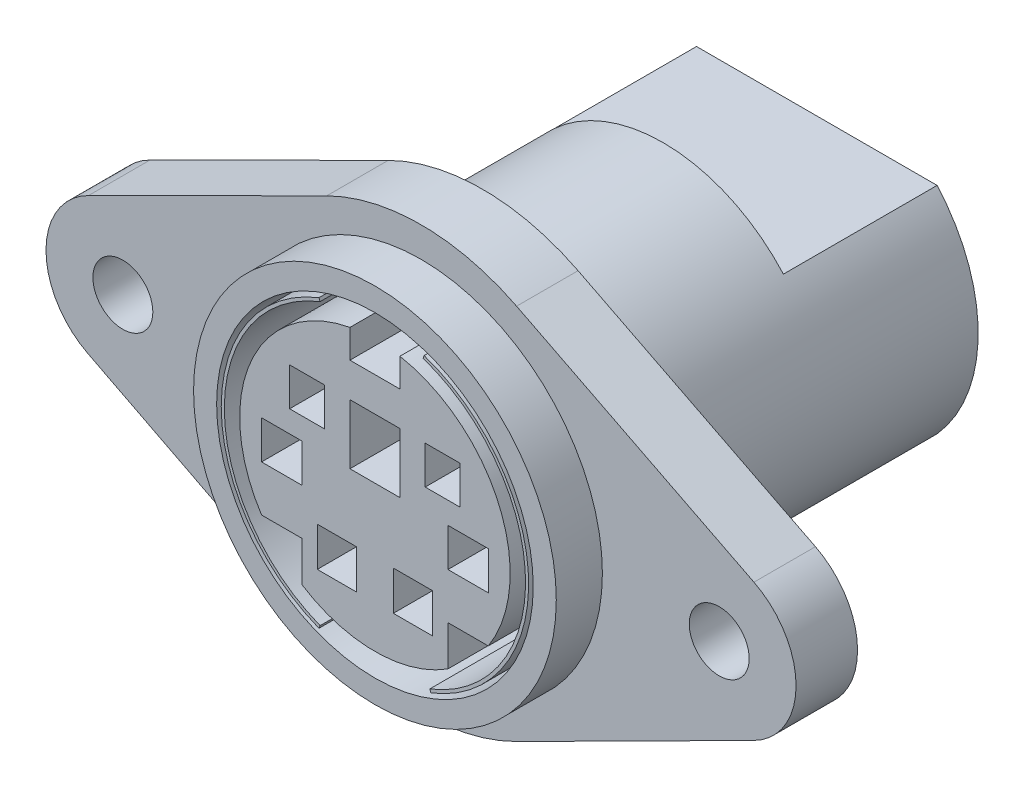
ISO-10303-21;
HEADER;
FILE_DESCRIPTION(('STEP AP214'),'2;1');
FILE_NAME('part.step','',(''),(''),'','','');
FILE_SCHEMA(('AUTOMOTIVE_DESIGN { 1 0 10303 214 1 1 1 1 }'));
ENDSEC;
DATA;
#1=APPLICATION_CONTEXT('core data for automotive mechanical design processes');
#2=APPLICATION_PROTOCOL_DEFINITION('international standard','automotive_design',2000,#1);
#3=PRODUCT_CONTEXT('',#1,'mechanical');
#4=PRODUCT('Part','Part','',(#3));
#5=PRODUCT_RELATED_PRODUCT_CATEGORY('part','',(#4));
#6=PRODUCT_DEFINITION_FORMATION('','',#4);
#7=PRODUCT_DEFINITION_CONTEXT('part definition',#1,'design');
#8=PRODUCT_DEFINITION('design','',#6,#7);
#9=PRODUCT_DEFINITION_SHAPE('','',#8);
#10=(LENGTH_UNIT() NAMED_UNIT(*) SI_UNIT(.MILLI.,.METRE.));
#11=(NAMED_UNIT(*) PLANE_ANGLE_UNIT() SI_UNIT($,.RADIAN.));
#12=(NAMED_UNIT(*) SI_UNIT($,.STERADIAN.) SOLID_ANGLE_UNIT());
#13=UNCERTAINTY_MEASURE_WITH_UNIT(LENGTH_MEASURE(1.E-05),#10,'distance_accuracy_value','');
#14=(GEOMETRIC_REPRESENTATION_CONTEXT(3) GLOBAL_UNCERTAINTY_ASSIGNED_CONTEXT((#13)) GLOBAL_UNIT_ASSIGNED_CONTEXT((#10,
#11,#12)) REPRESENTATION_CONTEXT('',''));
#15=CARTESIAN_POINT('',(0.,0.,0.));
#16=DIRECTION('',(0.,0.,1.));
#17=DIRECTION('',(1.,0.,0.));
#18=AXIS2_PLACEMENT_3D('',#15,#16,#17);
#19=CARTESIAN_POINT('',(0.,0.,-4.826));
#20=DIRECTION('',(0.,0.,1.));
#21=DIRECTION('',(1.,0.,0.));
#22=AXIS2_PLACEMENT_3D('',#19,#20,#21);
#23=PLANE('',#22);
#24=CARTESIAN_POINT('',(0.,0.,-4.826));
#25=DIRECTION('',(0.,0.,1.));
#26=DIRECTION('',(1.,0.,0.));
#27=AXIS2_PLACEMENT_3D('',#24,#25,#26);
#28=CIRCLE('',#27,4.4704);
#29=CARTESIAN_POINT('',(-0.825499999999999,4.3935209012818,-4.826));
#30=VERTEX_POINT('',#29);
#31=CARTESIAN_POINT('',(-3.74682286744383,-2.4384,-4.826));
#32=VERTEX_POINT('',#31);
#33=EDGE_CURVE('E739',#30,#32,#28,.T.);
#34=ORIENTED_EDGE('',*,*,#33,.F.);
#35=DIRECTION('',(0.,1.,0.));
#36=VECTOR('',#35,1.);
#37=CARTESIAN_POINT('',(-0.825499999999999,4.3935209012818,-4.826));
#38=LINE('',#37,#36);
#39=CARTESIAN_POINT('',(-0.825499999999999,3.4544,-4.826));
#40=VERTEX_POINT('',#39);
#41=EDGE_CURVE('E720',#40,#30,#38,.T.);
#42=ORIENTED_EDGE('',*,*,#41,.F.);
#43=DIRECTION('',(1.,0.,0.));
#44=VECTOR('',#43,1.);
#45=CARTESIAN_POINT('',(0.8255,3.4544,-4.826));
#46=LINE('',#45,#44);
#47=CARTESIAN_POINT('',(0.8255,3.4544,-4.826));
#48=VERTEX_POINT('',#47);
#49=EDGE_CURVE('E713',#40,#48,#46,.T.);
#50=ORIENTED_EDGE('',*,*,#49,.T.);
#51=DIRECTION('',(0.,1.,0.));
#52=VECTOR('',#51,1.);
#53=CARTESIAN_POINT('',(0.8255,4.3935209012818,-4.826));
#54=LINE('',#53,#52);
#55=CARTESIAN_POINT('',(0.8255,4.3935209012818,-4.826));
#56=VERTEX_POINT('',#55);
#57=EDGE_CURVE('E716',#48,#56,#54,.T.);
#58=ORIENTED_EDGE('',*,*,#57,.T.);
#59=CARTESIAN_POINT('',(3.74682286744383,-2.4384,-4.826));
#60=VERTEX_POINT('',#59);
#61=EDGE_CURVE('E738',#60,#56,#28,.T.);
#62=ORIENTED_EDGE('',*,*,#61,.F.);
#63=DIRECTION('',(1.,0.,0.));
#64=VECTOR('',#63,1.);
#65=CARTESIAN_POINT('',(3.74682286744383,-2.4384,-4.826));
#66=LINE('',#65,#64);
#67=CARTESIAN_POINT('',(2.413,-2.4384,-4.826));
#68=VERTEX_POINT('',#67);
#69=EDGE_CURVE('E618',#68,#60,#66,.T.);
#70=ORIENTED_EDGE('',*,*,#69,.F.);
#71=DIRECTION('',(0.,1.,0.));
#72=VECTOR('',#71,1.);
#73=CARTESIAN_POINT('',(2.413,-2.4384,-4.826));
#74=LINE('',#73,#72);
#75=CARTESIAN_POINT('',(2.413,-3.76323094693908,-4.826));
#76=VERTEX_POINT('',#75);
#77=EDGE_CURVE('E620',#76,#68,#74,.T.);
#78=ORIENTED_EDGE('',*,*,#77,.F.);
#79=CARTESIAN_POINT('',(-2.413,-3.76323094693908,-4.826));
#80=VERTEX_POINT('',#79);
#81=EDGE_CURVE('E743',#80,#76,#28,.T.);
#82=ORIENTED_EDGE('',*,*,#81,.F.);
#83=DIRECTION('',(0.,1.,0.));
#84=VECTOR('',#83,1.);
#85=CARTESIAN_POINT('',(-2.413,-2.4384,-4.826));
#86=LINE('',#85,#84);
#87=CARTESIAN_POINT('',(-2.413,-2.4384,-4.826));
#88=VERTEX_POINT('',#87);
#89=EDGE_CURVE('E665',#80,#88,#86,.T.);
#90=ORIENTED_EDGE('',*,*,#89,.T.);
#91=DIRECTION('',(1.,0.,0.));
#92=VECTOR('',#91,1.);
#93=CARTESIAN_POINT('',(-2.413,-2.4384,-4.826));
#94=LINE('',#93,#92);
#95=EDGE_CURVE('E668',#32,#88,#94,.T.);
#96=ORIENTED_EDGE('',*,*,#95,.F.);
#97=EDGE_LOOP('',(#34,#42,#50,#58,#62,#70,#78,#82,#90,#96));
#98=FACE_BOUND('',#97,.T.);
#99=CARTESIAN_POINT('',(0.,0.,-4.826));
#100=DIRECTION('',(0.,0.,1.));
#101=DIRECTION('',(1.,0.,0.));
#102=AXIS2_PLACEMENT_3D('',#99,#100,#101);
#103=CIRCLE('',#102,5.2324);
#104=CARTESIAN_POINT('',(5.2324,0.,-4.826));
#105=VERTEX_POINT('',#104);
#106=EDGE_CURVE('E749',#105,#105,#103,.T.);
#107=ORIENTED_EDGE('',*,*,#106,.T.);
#108=EDGE_LOOP('',(#107));
#109=FACE_BOUND('',#108,.T.);
#110=DIRECTION('',(-0.364077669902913,-0.931368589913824,0.));
#111=VECTOR('',#110,1.);
#112=CARTESIAN_POINT('',(-1.81252427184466,-4.63672538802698,-4.826));
#113=LINE('',#112,#111);
#114=CARTESIAN_POINT('',(-1.81252427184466,-4.63672538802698,-4.826));
#115=VERTEX_POINT('',#114);
#116=CARTESIAN_POINT('',(-1.8495145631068,-4.73135243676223,-4.826));
#117=VERTEX_POINT('',#116);
#118=EDGE_CURVE('E57',#115,#117,#113,.T.);
#119=ORIENTED_EDGE('',*,*,#118,.T.);
#120=CARTESIAN_POINT('',(0.,0.,-4.826));
#121=DIRECTION('',(0.,0.,1.));
#122=DIRECTION('',(1.,0.,0.));
#123=AXIS2_PLACEMENT_3D('',#120,#121,#122);
#124=CIRCLE('',#123,5.08);
#125=CARTESIAN_POINT('',(-1.8495145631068,4.73135243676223,-4.826));
#126=VERTEX_POINT('',#125);
#127=EDGE_CURVE('E438',#126,#117,#124,.T.);
#128=ORIENTED_EDGE('',*,*,#127,.F.);
#129=DIRECTION('',(-0.364077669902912,0.931368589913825,0.));
#130=VECTOR('',#129,1.);
#131=CARTESIAN_POINT('',(-1.81252427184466,4.63672538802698,-4.826));
#132=LINE('',#131,#130);
#133=CARTESIAN_POINT('',(-1.81252427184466,4.63672538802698,-4.826));
#134=VERTEX_POINT('',#133);
#135=EDGE_CURVE('E433',#134,#126,#132,.T.);
#136=ORIENTED_EDGE('',*,*,#135,.F.);
#137=CARTESIAN_POINT('',(0.,0.,-4.826));
#138=DIRECTION('',(0.,0.,1.));
#139=DIRECTION('',(1.,0.,0.));
#140=AXIS2_PLACEMENT_3D('',#137,#138,#139);
#141=CIRCLE('',#140,4.9784);
#142=EDGE_CURVE('E444',#134,#115,#141,.T.);
#143=ORIENTED_EDGE('',*,*,#142,.T.);
#144=EDGE_LOOP('',(#119,#128,#136,#143));
#145=FACE_BOUND('',#144,.T.);
#146=DIRECTION('',(0.319772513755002,0.94749434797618,0.));
#147=VECTOR('',#146,1.);
#148=CARTESIAN_POINT('',(1.59195548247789,4.71700586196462,-4.826));
#149=LINE('',#148,#147);
#150=CARTESIAN_POINT('',(1.59195548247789,4.71700586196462,-4.826));
#151=VERTEX_POINT('',#150);
#152=CARTESIAN_POINT('',(1.6244443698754,4.813271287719,-4.826));
#153=VERTEX_POINT('',#152);
#154=EDGE_CURVE('E416',#151,#153,#149,.T.);
#155=ORIENTED_EDGE('',*,*,#154,.T.);
#156=CARTESIAN_POINT('',(0.,0.,-4.826));
#157=DIRECTION('',(0.,0.,1.));
#158=DIRECTION('',(1.,0.,0.));
#159=AXIS2_PLACEMENT_3D('',#156,#157,#158);
#160=CIRCLE('',#159,5.08);
#161=CARTESIAN_POINT('',(1.84951456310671,-4.73135243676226,-4.826));
#162=VERTEX_POINT('',#161);
#163=EDGE_CURVE('E427',#162,#153,#160,.T.);
#164=ORIENTED_EDGE('',*,*,#163,.F.);
#165=DIRECTION('',(0.364077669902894,-0.931368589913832,0.));
#166=VECTOR('',#165,1.);
#167=CARTESIAN_POINT('',(1.81252427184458,-4.63672538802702,-4.826));
#168=LINE('',#167,#166);
#169=CARTESIAN_POINT('',(1.81252427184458,-4.63672538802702,-4.826));
#170=VERTEX_POINT('',#169);
#171=EDGE_CURVE('E405',#170,#162,#168,.T.);
#172=ORIENTED_EDGE('',*,*,#171,.F.);
#173=CARTESIAN_POINT('',(0.,0.,-4.826));
#174=DIRECTION('',(0.,0.,1.));
#175=DIRECTION('',(1.,0.,0.));
#176=AXIS2_PLACEMENT_3D('',#173,#174,#175);
#177=CIRCLE('',#176,4.9784);
#178=EDGE_CURVE('E49',#170,#151,#177,.T.);
#179=ORIENTED_EDGE('',*,*,#178,.T.);
#180=EDGE_LOOP('',(#155,#164,#172,#179));
#181=FACE_BOUND('',#180,.T.);
#182=ADVANCED_FACE('F34',(#98,#109,#145,#181),#23,.T.);
#183=CARTESIAN_POINT('',(0.,0.,1.524));
#184=DIRECTION('',(0.,0.,1.));
#185=DIRECTION('',(1.,0.,0.));
#186=AXIS2_PLACEMENT_3D('',#183,#184,#185);
#187=PLANE('',#186);
#188=DIRECTION('',(0.,1.,0.));
#189=VECTOR('',#188,1.);
#190=CARTESIAN_POINT('',(-0.6096,-3.0734,1.524));
#191=LINE('',#190,#189);
#192=CARTESIAN_POINT('',(-0.6096,-3.0734,1.524));
#193=VERTEX_POINT('',#192);
#194=CARTESIAN_POINT('',(-0.6096,-1.778,1.524));
#195=VERTEX_POINT('',#194);
#196=EDGE_CURVE('E508',#193,#195,#191,.T.);
#197=ORIENTED_EDGE('',*,*,#196,.F.);
#198=DIRECTION('',(-1.,0.,0.));
#199=VECTOR('',#198,1.);
#200=CARTESIAN_POINT('',(-0.6096,-3.0734,1.524));
#201=LINE('',#200,#199);
#202=CARTESIAN_POINT('',(-1.905,-3.0734,1.524));
#203=VERTEX_POINT('',#202);
#204=EDGE_CURVE('E505',#193,#203,#201,.T.);
#205=ORIENTED_EDGE('',*,*,#204,.T.);
#206=DIRECTION('',(0.,-1.,0.));
#207=VECTOR('',#206,1.);
#208=CARTESIAN_POINT('',(-1.905,-1.778,1.524));
#209=LINE('',#208,#207);
#210=CARTESIAN_POINT('',(-1.905,-1.778,1.524));
#211=VERTEX_POINT('',#210);
#212=EDGE_CURVE('E493',#211,#203,#209,.T.);
#213=ORIENTED_EDGE('',*,*,#212,.F.);
#214=DIRECTION('',(1.,0.,0.));
#215=VECTOR('',#214,1.);
#216=CARTESIAN_POINT('',(-1.905,-1.778,1.524));
#217=LINE('',#216,#215);
#218=EDGE_CURVE('E511',#211,#195,#217,.T.);
#219=ORIENTED_EDGE('',*,*,#218,.T.);
#220=EDGE_LOOP('',(#197,#205,#213,#219));
#221=FACE_BOUND('',#220,.T.);
#222=DIRECTION('',(-1.,0.,0.));
#223=VECTOR('',#222,1.);
#224=CARTESIAN_POINT('',(-2.413,0.347203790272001,1.524));
#225=LINE('',#224,#223);
#226=CARTESIAN_POINT('',(-2.413,0.347203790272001,1.524));
#227=VERTEX_POINT('',#226);
#228=CARTESIAN_POINT('',(-3.74682286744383,0.347203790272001,1.524));
#229=VERTEX_POINT('',#228);
#230=EDGE_CURVE('E574',#227,#229,#225,.T.);
#231=ORIENTED_EDGE('',*,*,#230,.F.);
#232=DIRECTION('',(0.,-1.,0.));
#233=VECTOR('',#232,1.);
#234=CARTESIAN_POINT('',(-2.413,0.347203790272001,1.524));
#235=LINE('',#234,#233);
#236=CARTESIAN_POINT('',(-2.413,-0.918610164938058,1.524));
#237=VERTEX_POINT('',#236);
#238=EDGE_CURVE('E533',#227,#237,#235,.T.);
#239=ORIENTED_EDGE('',*,*,#238,.T.);
#240=DIRECTION('',(1.,0.,0.));
#241=VECTOR('',#240,1.);
#242=CARTESIAN_POINT('',(-3.74682286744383,-0.918610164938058,1.524));
#243=LINE('',#242,#241);
#244=CARTESIAN_POINT('',(-3.74682286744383,-0.918610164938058,1.524));
#245=VERTEX_POINT('',#244);
#246=EDGE_CURVE('E568',#245,#237,#243,.T.);
#247=ORIENTED_EDGE('',*,*,#246,.F.);
#248=DIRECTION('',(0.,1.,0.));
#249=VECTOR('',#248,1.);
#250=CARTESIAN_POINT('',(-3.74682286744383,-0.918610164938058,1.524));
#251=LINE('',#250,#249);
#252=EDGE_CURVE('E571',#245,#229,#251,.T.);
#253=ORIENTED_EDGE('',*,*,#252,.T.);
#254=EDGE_LOOP('',(#231,#239,#247,#253));
#255=FACE_BOUND('',#254,.T.);
#256=DIRECTION('',(-1.,0.,0.));
#257=VECTOR('',#256,1.);
#258=CARTESIAN_POINT('',(-1.66214644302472,2.32454699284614,1.524));
#259=LINE('',#258,#257);
#260=CARTESIAN_POINT('',(-1.66214644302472,2.32454699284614,1.524));
#261=VERTEX_POINT('',#260);
#262=CARTESIAN_POINT('',(-2.8194,2.32454699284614,1.524));
#263=VERTEX_POINT('',#262);
#264=EDGE_CURVE('E652',#261,#263,#259,.T.);
#265=ORIENTED_EDGE('',*,*,#264,.F.);
#266=DIRECTION('',(0.,-1.,0.));
#267=VECTOR('',#266,1.);
#268=CARTESIAN_POINT('',(-1.66214644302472,2.32454699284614,1.524));
#269=LINE('',#268,#267);
#270=CARTESIAN_POINT('',(-1.66214644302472,1.0668,1.524));
#271=VERTEX_POINT('',#270);
#272=EDGE_CURVE('E633',#261,#271,#269,.T.);
#273=ORIENTED_EDGE('',*,*,#272,.T.);
#274=DIRECTION('',(1.,0.,0.));
#275=VECTOR('',#274,1.);
#276=CARTESIAN_POINT('',(-2.8194,1.0668,1.524));
#277=LINE('',#276,#275);
#278=CARTESIAN_POINT('',(-2.8194,1.0668,1.524));
#279=VERTEX_POINT('',#278);
#280=EDGE_CURVE('E646',#279,#271,#277,.T.);
#281=ORIENTED_EDGE('',*,*,#280,.F.);
#282=DIRECTION('',(0.,1.,0.));
#283=VECTOR('',#282,1.);
#284=CARTESIAN_POINT('',(-2.8194,1.0668,1.524));
#285=LINE('',#284,#283);
#286=EDGE_CURVE('E649',#279,#263,#285,.T.);
#287=ORIENTED_EDGE('',*,*,#286,.T.);
#288=EDGE_LOOP('',(#265,#273,#281,#287));
#289=FACE_BOUND('',#288,.T.);
#290=DIRECTION('',(0.,1.,0.));
#291=VECTOR('',#290,1.);
#292=CARTESIAN_POINT('',(0.8255,0.347203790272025,1.524));
#293=LINE('',#292,#291);
#294=CARTESIAN_POINT('',(0.8255,0.347203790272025,1.524));
#295=VERTEX_POINT('',#294);
#296=CARTESIAN_POINT('',(0.8255,2.32454699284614,1.524));
#297=VERTEX_POINT('',#296);
#298=EDGE_CURVE('E696',#295,#297,#293,.T.);
#299=ORIENTED_EDGE('',*,*,#298,.F.);
#300=DIRECTION('',(-1.,0.,0.));
#301=VECTOR('',#300,1.);
#302=CARTESIAN_POINT('',(0.8255,0.347203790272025,1.524));
#303=LINE('',#302,#301);
#304=CARTESIAN_POINT('',(-0.825500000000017,0.347203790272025,1.524));
#305=VERTEX_POINT('',#304);
#306=EDGE_CURVE('E693',#295,#305,#303,.T.);
#307=ORIENTED_EDGE('',*,*,#306,.T.);
#308=DIRECTION('',(0.,-1.,0.));
#309=VECTOR('',#308,1.);
#310=CARTESIAN_POINT('',(-0.825500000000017,2.32454699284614,1.524));
#311=LINE('',#310,#309);
#312=CARTESIAN_POINT('',(-0.825500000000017,2.32454699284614,1.524));
#313=VERTEX_POINT('',#312);
#314=EDGE_CURVE('E671',#313,#305,#311,.T.);
#315=ORIENTED_EDGE('',*,*,#314,.F.);
#316=DIRECTION('',(1.,0.,0.));
#317=VECTOR('',#316,1.);
#318=CARTESIAN_POINT('',(-0.825500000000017,2.32454699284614,1.524));
#319=LINE('',#318,#317);
#320=EDGE_CURVE('E699',#313,#297,#319,.T.);
#321=ORIENTED_EDGE('',*,*,#320,.T.);
#322=EDGE_LOOP('',(#299,#307,#315,#321));
#323=FACE_BOUND('',#322,.T.);
#324=DIRECTION('',(-1.,0.,0.));
#325=VECTOR('',#324,1.);
#326=CARTESIAN_POINT('',(3.74682286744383,-2.4384,1.524));
#327=LINE('',#326,#325);
#328=CARTESIAN_POINT('',(3.74682286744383,-2.4384,1.524));
#329=VERTEX_POINT('',#328);
#330=CARTESIAN_POINT('',(2.413,-2.4384,1.524));
#331=VERTEX_POINT('',#330);
#332=EDGE_CURVE('E595',#329,#331,#327,.T.);
#333=ORIENTED_EDGE('',*,*,#332,.F.);
#334=CARTESIAN_POINT('',(0.,0.,1.524));
#335=DIRECTION('',(0.,0.,1.));
#336=DIRECTION('',(1.,0.,0.));
#337=AXIS2_PLACEMENT_3D('',#334,#335,#336);
#338=CIRCLE('',#337,4.4704);
#339=CARTESIAN_POINT('',(0.8255,4.3935209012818,1.524));
#340=VERTEX_POINT('',#339);
#341=EDGE_CURVE('E742',#329,#340,#338,.T.);
#342=ORIENTED_EDGE('',*,*,#341,.T.);
#343=DIRECTION('',(0.,-1.,0.));
#344=VECTOR('',#343,1.);
#345=CARTESIAN_POINT('',(0.8255,4.3935209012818,1.524));
#346=LINE('',#345,#344);
#347=CARTESIAN_POINT('',(0.8255,3.4544,1.524));
#348=VERTEX_POINT('',#347);
#349=EDGE_CURVE('E726',#340,#348,#346,.T.);
#350=ORIENTED_EDGE('',*,*,#349,.T.);
#351=DIRECTION('',(-1.,0.,0.));
#352=VECTOR('',#351,1.);
#353=CARTESIAN_POINT('',(0.8255,3.4544,1.524));
#354=LINE('',#353,#352);
#355=CARTESIAN_POINT('',(-0.825499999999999,3.4544,1.524));
#356=VERTEX_POINT('',#355);
#357=EDGE_CURVE('E723',#348,#356,#354,.T.);
#358=ORIENTED_EDGE('',*,*,#357,.T.);
#359=DIRECTION('',(0.,-1.,0.));
#360=VECTOR('',#359,1.);
#361=CARTESIAN_POINT('',(-0.825499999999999,4.3935209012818,1.524));
#362=LINE('',#361,#360);
#363=CARTESIAN_POINT('',(-0.825499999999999,4.3935209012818,1.524));
#364=VERTEX_POINT('',#363);
#365=EDGE_CURVE('E690',#364,#356,#362,.T.);
#366=ORIENTED_EDGE('',*,*,#365,.F.);
#367=CARTESIAN_POINT('',(-3.74682286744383,-2.4384,1.524));
#368=VERTEX_POINT('',#367);
#369=EDGE_CURVE('E744',#364,#368,#338,.T.);
#370=ORIENTED_EDGE('',*,*,#369,.T.);
#371=DIRECTION('',(-1.,0.,0.));
#372=VECTOR('',#371,1.);
#373=CARTESIAN_POINT('',(-2.413,-2.4384,1.524));
#374=LINE('',#373,#372);
#375=CARTESIAN_POINT('',(-2.413,-2.4384,1.524));
#376=VERTEX_POINT('',#375);
#377=EDGE_CURVE('E664',#376,#368,#374,.T.);
#378=ORIENTED_EDGE('',*,*,#377,.F.);
#379=DIRECTION('',(0.,-1.,0.));
#380=VECTOR('',#379,1.);
#381=CARTESIAN_POINT('',(-2.413,-2.4384,1.524));
#382=LINE('',#381,#380);
#383=CARTESIAN_POINT('',(-2.413,-3.76323094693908,1.524));
#384=VERTEX_POINT('',#383);
#385=EDGE_CURVE('E673',#376,#384,#382,.T.);
#386=ORIENTED_EDGE('',*,*,#385,.T.);
#387=CARTESIAN_POINT('',(2.413,-3.76323094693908,1.524));
#388=VERTEX_POINT('',#387);
#389=EDGE_CURVE('E748',#384,#388,#338,.T.);
#390=ORIENTED_EDGE('',*,*,#389,.T.);
#391=DIRECTION('',(0.,-1.,0.));
#392=VECTOR('',#391,1.);
#393=CARTESIAN_POINT('',(2.413,-2.4384,1.524));
#394=LINE('',#393,#392);
#395=EDGE_CURVE('E624',#331,#388,#394,.T.);
#396=ORIENTED_EDGE('',*,*,#395,.F.);
#397=EDGE_LOOP('',(#333,#342,#350,#358,#366,#370,#378,#386,#390,#396));
#398=FACE_BOUND('',#397,.T.);
#399=DIRECTION('',(0.,1.,0.));
#400=VECTOR('',#399,1.);
#401=CARTESIAN_POINT('',(2.8194,1.0668,1.524));
#402=LINE('',#401,#400);
#403=CARTESIAN_POINT('',(2.8194,1.0668,1.524));
#404=VERTEX_POINT('',#403);
#405=CARTESIAN_POINT('',(2.8194,2.32454699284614,1.524));
#406=VERTEX_POINT('',#405);
#407=EDGE_CURVE('E601',#404,#406,#402,.T.);
#408=ORIENTED_EDGE('',*,*,#407,.F.);
#409=DIRECTION('',(-1.,0.,0.));
#410=VECTOR('',#409,1.);
#411=CARTESIAN_POINT('',(2.8194,1.0668,1.524));
#412=LINE('',#411,#410);
#413=CARTESIAN_POINT('',(1.66214644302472,1.0668,1.524));
#414=VERTEX_POINT('',#413);
#415=EDGE_CURVE('E598',#404,#414,#412,.T.);
#416=ORIENTED_EDGE('',*,*,#415,.T.);
#417=DIRECTION('',(0.,-1.,0.));
#418=VECTOR('',#417,1.);
#419=CARTESIAN_POINT('',(1.66214644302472,2.32454699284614,1.524));
#420=LINE('',#419,#418);
#421=CARTESIAN_POINT('',(1.66214644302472,2.32454699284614,1.524));
#422=VERTEX_POINT('',#421);
#423=EDGE_CURVE('E586',#422,#414,#420,.T.);
#424=ORIENTED_EDGE('',*,*,#423,.F.);
#425=DIRECTION('',(1.,0.,0.));
#426=VECTOR('',#425,1.);
#427=CARTESIAN_POINT('',(1.66214644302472,2.32454699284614,1.524));
#428=LINE('',#427,#426);
#429=EDGE_CURVE('E604',#422,#406,#428,.T.);
#430=ORIENTED_EDGE('',*,*,#429,.T.);
#431=EDGE_LOOP('',(#408,#416,#424,#430));
#432=FACE_BOUND('',#431,.T.);
#433=DIRECTION('',(0.,1.,0.));
#434=VECTOR('',#433,1.);
#435=CARTESIAN_POINT('',(3.74682286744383,-0.918610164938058,1.524));
#436=LINE('',#435,#434);
#437=CARTESIAN_POINT('',(3.74682286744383,-0.918610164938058,1.524));
#438=VERTEX_POINT('',#437);
#439=CARTESIAN_POINT('',(3.74682286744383,0.347203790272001,1.524));
#440=VERTEX_POINT('',#439);
#441=EDGE_CURVE('E539',#438,#440,#436,.T.);
#442=ORIENTED_EDGE('',*,*,#441,.F.);
#443=DIRECTION('',(-1.,0.,0.));
#444=VECTOR('',#443,1.);
#445=CARTESIAN_POINT('',(3.74682286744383,-0.918610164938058,1.524));
#446=LINE('',#445,#444);
#447=CARTESIAN_POINT('',(2.413,-0.918610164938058,1.524));
#448=VERTEX_POINT('',#447);
#449=EDGE_CURVE('E536',#438,#448,#446,.T.);
#450=ORIENTED_EDGE('',*,*,#449,.T.);
#451=DIRECTION('',(0.,-1.,0.));
#452=VECTOR('',#451,1.);
#453=CARTESIAN_POINT('',(2.413,0.347203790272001,1.524));
#454=LINE('',#453,#452);
#455=CARTESIAN_POINT('',(2.413,0.347203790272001,1.524));
#456=VERTEX_POINT('',#455);
#457=EDGE_CURVE('E502',#456,#448,#454,.T.);
#458=ORIENTED_EDGE('',*,*,#457,.F.);
#459=DIRECTION('',(1.,0.,0.));
#460=VECTOR('',#459,1.);
#461=CARTESIAN_POINT('',(2.413,0.347203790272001,1.524));
#462=LINE('',#461,#460);
#463=EDGE_CURVE('E542',#456,#440,#462,.T.);
#464=ORIENTED_EDGE('',*,*,#463,.T.);
#465=EDGE_LOOP('',(#442,#450,#458,#464));
#466=FACE_BOUND('',#465,.T.);
#467=DIRECTION('',(-1.,0.,0.));
#468=VECTOR('',#467,1.);
#469=CARTESIAN_POINT('',(1.905,-1.778,1.524));
#470=LINE('',#469,#468);
#471=CARTESIAN_POINT('',(1.905,-1.778,1.524));
#472=VERTEX_POINT('',#471);
#473=CARTESIAN_POINT('',(0.6096,-1.778,1.524));
#474=VERTEX_POINT('',#473);
#475=EDGE_CURVE('E481',#472,#474,#470,.T.);
#476=ORIENTED_EDGE('',*,*,#475,.F.);
#477=DIRECTION('',(0.,-1.,0.));
#478=VECTOR('',#477,1.);
#479=CARTESIAN_POINT('',(1.905,-1.778,1.524));
#480=LINE('',#479,#478);
#481=CARTESIAN_POINT('',(1.905,-3.0734,1.524));
#482=VERTEX_POINT('',#481);
#483=EDGE_CURVE('E462',#472,#482,#480,.T.);
#484=ORIENTED_EDGE('',*,*,#483,.T.);
#485=DIRECTION('',(1.,0.,0.));
#486=VECTOR('',#485,1.);
#487=CARTESIAN_POINT('',(0.6096,-3.0734,1.524));
#488=LINE('',#487,#486);
#489=CARTESIAN_POINT('',(0.6096,-3.0734,1.524));
#490=VERTEX_POINT('',#489);
#491=EDGE_CURVE('E475',#490,#482,#488,.T.);
#492=ORIENTED_EDGE('',*,*,#491,.F.);
#493=DIRECTION('',(0.,1.,0.));
#494=VECTOR('',#493,1.);
#495=CARTESIAN_POINT('',(0.6096,-3.0734,1.524));
#496=LINE('',#495,#494);
#497=EDGE_CURVE('E478',#490,#474,#496,.T.);
#498=ORIENTED_EDGE('',*,*,#497,.T.);
#499=EDGE_LOOP('',(#476,#484,#492,#498));
#500=FACE_BOUND('',#499,.T.);
#501=ADVANCED_FACE('F878',(#221,#255,#289,#323,#398,#432,#466,#500),#187,.T.);
#502=CARTESIAN_POINT('',(0.,0.,14.1682006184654));
#503=DIRECTION('',(0.,0.,-1.));
#504=DIRECTION('',(-1.,0.,0.));
#505=AXIS2_PLACEMENT_3D('',#502,#503,#504);
#506=CYLINDRICAL_SURFACE('',#505,4.4704);
#507=ORIENTED_EDGE('',*,*,#341,.F.);
#508=DIRECTION('',(0.,0.,1.));
#509=VECTOR('',#508,1.);
#510=CARTESIAN_POINT('',(3.74682286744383,-2.4384,-7.40198275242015));
#511=LINE('',#510,#509);
#512=EDGE_CURVE('E621',#60,#329,#511,.T.);
#513=ORIENTED_EDGE('',*,*,#512,.F.);
#514=ORIENTED_EDGE('',*,*,#61,.T.);
#515=DIRECTION('',(0.,0.,1.));
#516=VECTOR('',#515,1.);
#517=CARTESIAN_POINT('',(0.8255,4.3935209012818,-7.40198275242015));
#518=LINE('',#517,#516);
#519=EDGE_CURVE('E717',#56,#340,#518,.T.);
#520=ORIENTED_EDGE('',*,*,#519,.T.);
#521=EDGE_LOOP('',(#507,#513,#514,#520));
#522=FACE_BOUND('',#521,.T.);
#523=ADVANCED_FACE('F884',(#522),#506,.T.);
#524=ORIENTED_EDGE('',*,*,#81,.T.);
#525=DIRECTION('',(0.,0.,1.));
#526=VECTOR('',#525,1.);
#527=CARTESIAN_POINT('',(2.413,-3.76323094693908,-7.40198275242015));
#528=LINE('',#527,#526);
#529=EDGE_CURVE('E628',#76,#388,#528,.T.);
#530=ORIENTED_EDGE('',*,*,#529,.T.);
#531=ORIENTED_EDGE('',*,*,#389,.F.);
#532=DIRECTION('',(0.,0.,1.));
#533=VECTOR('',#532,1.);
#534=CARTESIAN_POINT('',(-2.413,-3.76323094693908,-7.40198275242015));
#535=LINE('',#534,#533);
#536=EDGE_CURVE('E678',#80,#384,#535,.T.);
#537=ORIENTED_EDGE('',*,*,#536,.F.);
#538=EDGE_LOOP('',(#524,#530,#531,#537));
#539=FACE_BOUND('',#538,.T.);
#540=ADVANCED_FACE('F1490',(#539),#506,.T.);
#541=ORIENTED_EDGE('',*,*,#33,.T.);
#542=DIRECTION('',(0.,0.,1.));
#543=VECTOR('',#542,1.);
#544=CARTESIAN_POINT('',(-3.74682286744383,-2.4384,-7.40198275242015));
#545=LINE('',#544,#543);
#546=EDGE_CURVE('E676',#32,#368,#545,.T.);
#547=ORIENTED_EDGE('',*,*,#546,.T.);
#548=ORIENTED_EDGE('',*,*,#369,.F.);
#549=DIRECTION('',(0.,0.,1.));
#550=VECTOR('',#549,1.);
#551=CARTESIAN_POINT('',(-0.825499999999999,4.3935209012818,-7.40198275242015));
#552=LINE('',#551,#550);
#553=EDGE_CURVE('E729',#30,#364,#552,.T.);
#554=ORIENTED_EDGE('',*,*,#553,.F.);
#555=EDGE_LOOP('',(#541,#547,#548,#554));
#556=FACE_BOUND('',#555,.T.);
#557=ADVANCED_FACE('F919',(#556),#506,.T.);
#558=CARTESIAN_POINT('',(0.,0.,-13.081));
#559=DIRECTION('',(0.,0.,1.));
#560=DIRECTION('',(1.,0.,0.));
#561=AXIS2_PLACEMENT_3D('',#558,#559,#560);
#562=CYLINDRICAL_SURFACE('',#561,5.334);
#563=CARTESIAN_POINT('',(0.,0.,-2.032));
#564=DIRECTION('',(0.,0.,-1.));
#565=DIRECTION('',(-1.,0.,0.));
#566=AXIS2_PLACEMENT_3D('',#563,#564,#565);
#567=CIRCLE('',#566,5.334);
#568=CARTESIAN_POINT('',(-5.334,0.,-2.032));
#569=VERTEX_POINT('',#568);
#570=EDGE_CURVE('E779',#569,#569,#567,.T.);
#571=ORIENTED_EDGE('',*,*,#570,.T.);
#572=EDGE_LOOP('',(#571));
#573=FACE_BOUND('',#572,.T.);
#574=DIRECTION('',(0.,0.,-1.));
#575=VECTOR('',#574,1.);
#576=CARTESIAN_POINT('',(3.97572886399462,-3.556,-8.001));
#577=LINE('',#576,#575);
#578=CARTESIAN_POINT('',(3.97572886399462,-3.556,-8.001));
#579=VERTEX_POINT('',#578);
#580=CARTESIAN_POINT('',(3.97572886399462,-3.556,-13.081));
#581=VERTEX_POINT('',#580);
#582=EDGE_CURVE('E763',#579,#581,#577,.T.);
#583=ORIENTED_EDGE('',*,*,#582,.T.);
#584=CARTESIAN_POINT('',(0.,0.,-13.081));
#585=DIRECTION('',(0.,0.,-1.));
#586=DIRECTION('',(-1.,0.,0.));
#587=AXIS2_PLACEMENT_3D('',#584,#585,#586);
#588=CIRCLE('',#587,5.334);
#589=CARTESIAN_POINT('',(3.97572886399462,3.556,-13.081));
#590=VERTEX_POINT('',#589);
#591=EDGE_CURVE('E781',#590,#581,#588,.T.);
#592=ORIENTED_EDGE('',*,*,#591,.F.);
#593=DIRECTION('',(0.,0.,-1.));
#594=VECTOR('',#593,1.);
#595=CARTESIAN_POINT('',(3.97572886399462,3.556,-8.001));
#596=LINE('',#595,#594);
#597=CARTESIAN_POINT('',(3.97572886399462,3.556,-8.001));
#598=VERTEX_POINT('',#597);
#599=EDGE_CURVE('E773',#598,#590,#596,.T.);
#600=ORIENTED_EDGE('',*,*,#599,.F.);
#601=CARTESIAN_POINT('',(0.,0.,-8.001));
#602=DIRECTION('',(0.,0.,-1.));
#603=DIRECTION('',(-1.,0.,0.));
#604=AXIS2_PLACEMENT_3D('',#601,#602,#603);
#605=CIRCLE('',#604,5.334);
#606=CARTESIAN_POINT('',(-3.97572886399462,3.556,-8.001));
#607=VERTEX_POINT('',#606);
#608=EDGE_CURVE('E768',#607,#598,#605,.T.);
#609=ORIENTED_EDGE('',*,*,#608,.F.);
#610=DIRECTION('',(0.,0.,-1.));
#611=VECTOR('',#610,1.);
#612=CARTESIAN_POINT('',(-3.97572886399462,3.556,-8.001));
#613=LINE('',#612,#611);
#614=CARTESIAN_POINT('',(-3.97572886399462,3.556,-13.081));
#615=VERTEX_POINT('',#614);
#616=EDGE_CURVE('E776',#607,#615,#613,.T.);
#617=ORIENTED_EDGE('',*,*,#616,.T.);
#618=CARTESIAN_POINT('',(-3.97572886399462,-3.556,-13.081));
#619=VERTEX_POINT('',#618);
#620=EDGE_CURVE('E785',#619,#615,#588,.T.);
#621=ORIENTED_EDGE('',*,*,#620,.F.);
#622=DIRECTION('',(0.,0.,-1.));
#623=VECTOR('',#622,1.);
#624=CARTESIAN_POINT('',(-3.97572886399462,-3.556,-8.001));
#625=LINE('',#624,#623);
#626=CARTESIAN_POINT('',(-3.97572886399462,-3.556,-8.001));
#627=VERTEX_POINT('',#626);
#628=EDGE_CURVE('E760',#627,#619,#625,.T.);
#629=ORIENTED_EDGE('',*,*,#628,.F.);
#630=CARTESIAN_POINT('',(0.,0.,-8.001));
#631=DIRECTION('',(0.,0.,-1.));
#632=DIRECTION('',(-1.,0.,0.));
#633=AXIS2_PLACEMENT_3D('',#630,#631,#632);
#634=CIRCLE('',#633,5.334);
#635=EDGE_CURVE('E755',#579,#627,#634,.T.);
#636=ORIENTED_EDGE('',*,*,#635,.F.);
#637=EDGE_LOOP('',(#583,#592,#600,#609,#617,#621,#629,#636));
#638=FACE_BOUND('',#637,.T.);
#639=ADVANCED_FACE('F915',(#573,#638),#562,.T.);
#640=CARTESIAN_POINT('',(0.,0.,-13.081));
#641=DIRECTION('',(0.,0.,-1.));
#642=DIRECTION('',(-1.,0.,0.));
#643=AXIS2_PLACEMENT_3D('',#640,#641,#642);
#644=PLANE('',#643);
#645=ORIENTED_EDGE('',*,*,#591,.T.);
#646=DIRECTION('',(-1.,0.,0.));
#647=VECTOR('',#646,1.);
#648=CARTESIAN_POINT('',(3.97572886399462,-3.556,-13.081));
#649=LINE('',#648,#647);
#650=EDGE_CURVE('E752',#581,#619,#649,.T.);
#651=ORIENTED_EDGE('',*,*,#650,.T.);
#652=ORIENTED_EDGE('',*,*,#620,.T.);
#653=DIRECTION('',(1.,0.,0.));
#654=VECTOR('',#653,1.);
#655=CARTESIAN_POINT('',(-3.97572886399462,3.556,-13.081));
#656=LINE('',#655,#654);
#657=EDGE_CURVE('E766',#615,#590,#656,.T.);
#658=ORIENTED_EDGE('',*,*,#657,.T.);
#659=EDGE_LOOP('',(#645,#651,#652,#658));
#660=FACE_BOUND('',#659,.T.);
#661=ADVANCED_FACE('F873',(#660),#644,.T.);
#662=CARTESIAN_POINT('',(0.,0.,-2.032));
#663=DIRECTION('',(0.,0.,-1.));
#664=DIRECTION('',(-1.,0.,0.));
#665=AXIS2_PLACEMENT_3D('',#662,#663,#664);
#666=PLANE('',#665);
#667=CARTESIAN_POINT('',(0.,0.,-2.032));
#668=DIRECTION('',(0.,0.,-1.));
#669=DIRECTION('',(-1.,0.,0.));
#670=AXIS2_PLACEMENT_3D('',#667,#668,#669);
#671=CIRCLE('',#670,6.985);
#672=CARTESIAN_POINT('',(-3.1175746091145,6.25067624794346,-2.032));
#673=VERTEX_POINT('',#672);
#674=CARTESIAN_POINT('',(3.15833554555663,6.23017989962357,-2.032));
#675=VERTEX_POINT('',#674);
#676=EDGE_CURVE('E800',#673,#675,#671,.T.);
#677=ORIENTED_EDGE('',*,*,#676,.T.);
#678=DIRECTION('',(0.891936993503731,-0.452159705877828,0.));
#679=VECTOR('',#678,1.);
#680=CARTESIAN_POINT('',(3.15833554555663,6.23017989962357,-2.032));
#681=LINE('',#680,#679);
#682=CARTESIAN_POINT('',(11.0037163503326,2.25303229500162,-2.032));
#683=VERTEX_POINT('',#682);
#684=EDGE_CURVE('E803',#675,#683,#681,.T.);
#685=ORIENTED_EDGE('',*,*,#684,.T.);
#686=CARTESIAN_POINT('',(9.85523069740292,-0.0124876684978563,-2.032));
#687=DIRECTION('',(0.,0.,-1.));
#688=DIRECTION('',(-1.,0.,0.));
#689=AXIS2_PLACEMENT_3D('',#686,#687,#688);
#690=CIRCLE('',#689,2.54);
#691=CARTESIAN_POINT('',(10.9979713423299,-2.28091086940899,-2.032));
#692=VERTEX_POINT('',#691);
#693=EDGE_CURVE('E806',#683,#692,#690,.T.);
#694=ORIENTED_EDGE('',*,*,#693,.T.);
#695=DIRECTION('',(0.893080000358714,0.449897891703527,0.));
#696=VECTOR('',#695,1.);
#697=CARTESIAN_POINT('',(3.14253677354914,-6.23816380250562,-2.032));
#698=LINE('',#697,#696);
#699=CARTESIAN_POINT('',(3.14253677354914,-6.23816380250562,-2.032));
#700=VERTEX_POINT('',#699);
#701=EDGE_CURVE('E808',#700,#692,#698,.T.);
#702=ORIENTED_EDGE('',*,*,#701,.F.);
#703=CARTESIAN_POINT('',(0.,0.,-2.032));
#704=DIRECTION('',(0.,0.,-1.));
#705=DIRECTION('',(-1.,0.,0.));
#706=AXIS2_PLACEMENT_3D('',#703,#704,#705);
#707=CIRCLE('',#706,6.985);
#708=CARTESIAN_POINT('',(-3.18282015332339,-6.21770704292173,-2.032));
#709=VERTEX_POINT('',#708);
#710=EDGE_CURVE('E811',#700,#709,#707,.T.);
#711=ORIENTED_EDGE('',*,*,#710,.T.);
#712=DIRECTION('',(0.890151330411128,-0.45566501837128,0.));
#713=VECTOR('',#712,1.);
#714=CARTESIAN_POINT('',(-11.0131127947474,-2.20941056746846,-2.032));
#715=LINE('',#714,#713);
#716=CARTESIAN_POINT('',(-11.0131127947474,-2.20941056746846,-2.032));
#717=VERTEX_POINT('',#716);
#718=EDGE_CURVE('E813',#717,#709,#715,.T.);
#719=ORIENTED_EDGE('',*,*,#718,.F.);
#720=CARTESIAN_POINT('',(-9.85572364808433,0.0515738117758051,-2.032));
#721=DIRECTION('',(0.,0.,-1.));
#722=DIRECTION('',(-1.,0.,0.));
#723=AXIS2_PLACEMENT_3D('',#720,#721,#722);
#724=CIRCLE('',#723,2.54);
#725=CARTESIAN_POINT('',(-10.9893871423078,2.32454699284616,-2.032));
#726=VERTEX_POINT('',#725);
#727=EDGE_CURVE('E816',#717,#726,#724,.T.);
#728=ORIENTED_EDGE('',*,*,#727,.T.);
#729=DIRECTION('',(-0.894871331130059,-0.446324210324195,0.));
#730=VECTOR('',#729,1.);
#731=CARTESIAN_POINT('',(-3.1175746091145,6.25067624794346,-2.032));
#732=LINE('',#731,#730);
#733=EDGE_CURVE('E818',#673,#726,#732,.T.);
#734=ORIENTED_EDGE('',*,*,#733,.F.);
#735=EDGE_LOOP('',(#677,#685,#694,#702,#711,#719,#728,#734));
#736=FACE_BOUND('',#735,.T.);
#737=CARTESIAN_POINT('',(9.85523069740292,-0.0124876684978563,-2.032));
#738=DIRECTION('',(0.,0.,1.));
#739=DIRECTION('',(1.,0.,0.));
#740=AXIS2_PLACEMENT_3D('',#737,#738,#739);
#741=CIRCLE('',#740,0.990599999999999);
#742=CARTESIAN_POINT('',(10.8458306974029,-0.0124876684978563,-2.032));
#743=VERTEX_POINT('',#742);
#744=EDGE_CURVE('E794',#743,#743,#741,.T.);
#745=ORIENTED_EDGE('',*,*,#744,.T.);
#746=EDGE_LOOP('',(#745));
#747=FACE_BOUND('',#746,.T.);
#748=CARTESIAN_POINT('',(-9.85572364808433,0.0515738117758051,-2.032));
#749=DIRECTION('',(0.,0.,1.));
#750=DIRECTION('',(1.,0.,0.));
#751=AXIS2_PLACEMENT_3D('',#748,#749,#750);
#752=CIRCLE('',#751,0.990599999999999);
#753=CARTESIAN_POINT('',(-8.86512364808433,0.0515738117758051,-2.032));
#754=VERTEX_POINT('',#753);
#755=EDGE_CURVE('E788',#754,#754,#752,.T.);
#756=ORIENTED_EDGE('',*,*,#755,.T.);
#757=EDGE_LOOP('',(#756));
#758=FACE_BOUND('',#757,.T.);
#759=ORIENTED_EDGE('',*,*,#570,.F.);
#760=EDGE_LOOP('',(#759));
#761=FACE_BOUND('',#760,.T.);
#762=ADVANCED_FACE('F866',(#736,#747,#758,#761),#666,.T.);
#763=CARTESIAN_POINT('',(0.,0.,1.524));
#764=DIRECTION('',(0.,0.,-1.));
#765=DIRECTION('',(-1.,0.,0.));
#766=AXIS2_PLACEMENT_3D('',#763,#764,#765);
#767=CYLINDRICAL_SURFACE('',#766,5.9944);
#768=CARTESIAN_POINT('',(0.,0.,1.524));
#769=DIRECTION('',(0.,0.,1.));
#770=DIRECTION('',(1.,0.,0.));
#771=AXIS2_PLACEMENT_3D('',#768,#769,#770);
#772=CIRCLE('',#771,5.9944);
#773=CARTESIAN_POINT('',(-5.9944,0.,1.524));
#774=VERTEX_POINT('',#773);
#775=EDGE_CURVE('E11',#774,#774,#772,.T.);
#776=CARTESIAN_POINT('',(0.,0.,0.));
#777=DIRECTION('',(0.,0.,-1.));
#778=DIRECTION('',(-1.,0.,0.));
#779=AXIS2_PLACEMENT_3D('',#776,#777,#778);
#780=CIRCLE('',#779,5.9944);
#781=CARTESIAN_POINT('',(-5.9944,0.,0.));
#782=VERTEX_POINT('',#781);
#783=EDGE_CURVE('E42',#782,#782,#780,.T.);
#784=CARTESIAN_POINT('',(-5.9944,0.,1.524));
#785=CARTESIAN_POINT('',(-5.9944,0.,1.508125));
#786=CARTESIAN_POINT('',(-5.9944,0.,1.49225));
#787=CARTESIAN_POINT('',(-5.9944,0.,1.4605));
#788=CARTESIAN_POINT('',(-5.9944,0.,1.444625));
#789=CARTESIAN_POINT('',(-5.9944,0.,1.412875));
#790=CARTESIAN_POINT('',(-5.9944,0.,1.397));
#791=CARTESIAN_POINT('',(-5.9944,0.,1.36525));
#792=CARTESIAN_POINT('',(-5.9944,0.,1.349375));
#793=CARTESIAN_POINT('',(-5.9944,0.,1.317625));
#794=CARTESIAN_POINT('',(-5.9944,0.,1.30175));
#795=CARTESIAN_POINT('',(-5.9944,0.,1.27));
#796=CARTESIAN_POINT('',(-5.9944,0.,1.254125));
#797=CARTESIAN_POINT('',(-5.9944,0.,1.222375));
#798=CARTESIAN_POINT('',(-5.9944,0.,1.2065));
#799=CARTESIAN_POINT('',(-5.9944,0.,1.17475));
#800=CARTESIAN_POINT('',(-5.9944,0.,1.158875));
#801=CARTESIAN_POINT('',(-5.9944,0.,1.127125));
#802=CARTESIAN_POINT('',(-5.9944,0.,1.11125));
#803=CARTESIAN_POINT('',(-5.9944,0.,1.0795));
#804=CARTESIAN_POINT('',(-5.9944,0.,1.063625));
#805=CARTESIAN_POINT('',(-5.9944,0.,1.031875));
#806=CARTESIAN_POINT('',(-5.9944,0.,1.016));
#807=CARTESIAN_POINT('',(-5.9944,0.,0.98425));
#808=CARTESIAN_POINT('',(-5.9944,0.,0.968375));
#809=CARTESIAN_POINT('',(-5.9944,0.,0.936625));
#810=CARTESIAN_POINT('',(-5.9944,0.,0.92075));
#811=CARTESIAN_POINT('',(-5.9944,0.,0.889));
#812=CARTESIAN_POINT('',(-5.9944,0.,0.873125));
#813=CARTESIAN_POINT('',(-5.9944,0.,0.841375));
#814=CARTESIAN_POINT('',(-5.9944,0.,0.8255));
#815=CARTESIAN_POINT('',(-5.9944,0.,0.79375));
#816=CARTESIAN_POINT('',(-5.9944,0.,0.777875));
#817=CARTESIAN_POINT('',(-5.9944,0.,0.746125));
#818=CARTESIAN_POINT('',(-5.9944,0.,0.73025));
#819=CARTESIAN_POINT('',(-5.9944,0.,0.6985));
#820=CARTESIAN_POINT('',(-5.9944,0.,0.682625));
#821=CARTESIAN_POINT('',(-5.9944,0.,0.650875));
#822=CARTESIAN_POINT('',(-5.9944,0.,0.635));
#823=CARTESIAN_POINT('',(-5.9944,0.,0.60325));
#824=CARTESIAN_POINT('',(-5.9944,0.,0.587375));
#825=CARTESIAN_POINT('',(-5.9944,0.,0.555625));
#826=CARTESIAN_POINT('',(-5.9944,0.,0.53975));
#827=CARTESIAN_POINT('',(-5.9944,0.,0.508));
#828=CARTESIAN_POINT('',(-5.9944,0.,0.492125));
#829=CARTESIAN_POINT('',(-5.9944,0.,0.460375));
#830=CARTESIAN_POINT('',(-5.9944,0.,0.4445));
#831=CARTESIAN_POINT('',(-5.9944,0.,0.41275));
#832=CARTESIAN_POINT('',(-5.9944,0.,0.396875));
#833=CARTESIAN_POINT('',(-5.9944,0.,0.365125));
#834=CARTESIAN_POINT('',(-5.9944,0.,0.34925));
#835=CARTESIAN_POINT('',(-5.9944,0.,0.3175));
#836=CARTESIAN_POINT('',(-5.9944,0.,0.301625));
#837=CARTESIAN_POINT('',(-5.9944,0.,0.269875));
#838=CARTESIAN_POINT('',(-5.9944,0.,0.254));
#839=CARTESIAN_POINT('',(-5.9944,0.,0.22225));
#840=CARTESIAN_POINT('',(-5.9944,0.,0.206375));
#841=CARTESIAN_POINT('',(-5.9944,0.,0.174625));
#842=CARTESIAN_POINT('',(-5.9944,0.,0.15875));
#843=CARTESIAN_POINT('',(-5.9944,0.,0.127));
#844=CARTESIAN_POINT('',(-5.9944,0.,0.111125));
#845=CARTESIAN_POINT('',(-5.9944,0.,0.079375));
#846=CARTESIAN_POINT('',(-5.9944,0.,0.0635));
#847=CARTESIAN_POINT('',(-5.9944,0.,0.0317499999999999));
#848=CARTESIAN_POINT('',(-5.9944,0.,0.015875));
#849=CARTESIAN_POINT('',(-5.9944,0.,0.));
#850=B_SPLINE_CURVE_WITH_KNOTS('',3,(#784,#785,#786,#787,#788,#789,#790,#791,#792,#793,#794,
#795,#796,#797,#798,#799,#800,#801,#802,#803,#804,#805,#806,#807,#808,#809,#810,#811,#812,#813,
#814,#815,#816,#817,#818,#819,#820,#821,#822,#823,#824,#825,#826,#827,#828,#829,#830,#831,#832,
#833,#834,#835,#836,#837,#838,#839,#840,#841,#842,#843,#844,#845,#846,#847,#848,#849),
.UNSPECIFIED.,.F.,.F.,(4,2,2,2,2,2,2,2,2,2,2,2,2,2,2,2,2,2,2,2,2,2,2,2,2,2,2,2,2,2,2,2,4),(0.,
0.0476250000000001,0.0952500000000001,0.142875,0.1905,0.238125,0.28575,0.333375,0.381,0.428625,
0.47625,0.523875,0.5715,0.619125,0.66675,0.714375,0.762,0.809625,0.85725,0.904875,0.9525,
1.000125,1.04775,1.095375,1.143,1.190625,1.23825,1.285875,1.3335,1.381125,1.42875,1.476375,
1.524),.UNSPECIFIED.);
#851=EDGE_CURVE('BSEAM36',#774,#782,#850,.T.);
#852=ORIENTED_EDGE('',*,*,#775,.F.);
#853=ORIENTED_EDGE('',*,*,#783,.F.);
#854=ORIENTED_EDGE('',*,*,#851,.T.);
#855=ORIENTED_EDGE('',*,*,#851,.F.);
#856=EDGE_LOOP('',(#852,#854,#853,#855));
#857=FACE_BOUND('',#856,.T.);
#858=ADVANCED_FACE('F36',(#857),#767,.T.);
#859=CARTESIAN_POINT('',(0.,0.,1.524));
#860=DIRECTION('',(0.,0.,1.));
#861=DIRECTION('',(1.,0.,0.));
#862=AXIS2_PLACEMENT_3D('',#859,#860,#861);
#863=PLANE('',#862);
#864=CARTESIAN_POINT('',(0.,0.,1.524));
#865=DIRECTION('',(0.,0.,1.));
#866=DIRECTION('',(1.,0.,0.));
#867=AXIS2_PLACEMENT_3D('',#864,#865,#866);
#868=CIRCLE('',#867,5.2324);
#869=CARTESIAN_POINT('',(5.2324,0.,1.524));
#870=VERTEX_POINT('',#869);
#871=EDGE_CURVE('E747',#870,#870,#868,.T.);
#872=ORIENTED_EDGE('',*,*,#871,.F.);
#873=EDGE_LOOP('',(#872));
#874=FACE_BOUND('',#873,.T.);
#875=ORIENTED_EDGE('',*,*,#775,.T.);
#876=EDGE_LOOP('',(#875));
#877=FACE_BOUND('',#876,.T.);
#878=ADVANCED_FACE('F865',(#874,#877),#863,.T.);
#879=CARTESIAN_POINT('',(0.,0.,0.));
#880=DIRECTION('',(0.,0.,-1.));
#881=DIRECTION('',(-1.,0.,0.));
#882=AXIS2_PLACEMENT_3D('',#879,#880,#881);
#883=PLANE('',#882);
#884=CARTESIAN_POINT('',(-9.85572364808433,0.0515738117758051,0.));
#885=DIRECTION('',(0.,0.,1.));
#886=DIRECTION('',(1.,0.,0.));
#887=AXIS2_PLACEMENT_3D('',#884,#885,#886);
#888=CIRCLE('',#887,0.990599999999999);
#889=CARTESIAN_POINT('',(-8.86512364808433,0.0515738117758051,0.));
#890=VERTEX_POINT('',#889);
#891=EDGE_CURVE('E784',#890,#890,#888,.T.);
#892=ORIENTED_EDGE('',*,*,#891,.F.);
#893=EDGE_LOOP('',(#892));
#894=FACE_BOUND('',#893,.T.);
#895=CARTESIAN_POINT('',(9.85523069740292,-0.0124876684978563,0.));
#896=DIRECTION('',(0.,0.,1.));
#897=DIRECTION('',(1.,0.,0.));
#898=AXIS2_PLACEMENT_3D('',#895,#896,#897);
#899=CIRCLE('',#898,0.990599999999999);
#900=CARTESIAN_POINT('',(10.8458306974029,-0.0124876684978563,0.));
#901=VERTEX_POINT('',#900);
#902=EDGE_CURVE('E791',#901,#901,#899,.T.);
#903=ORIENTED_EDGE('',*,*,#902,.F.);
#904=EDGE_LOOP('',(#903));
#905=FACE_BOUND('',#904,.T.);
#906=CARTESIAN_POINT('',(0.,0.,0.));
#907=DIRECTION('',(0.,0.,-1.));
#908=DIRECTION('',(-1.,0.,0.));
#909=AXIS2_PLACEMENT_3D('',#906,#907,#908);
#910=CIRCLE('',#909,6.985);
#911=CARTESIAN_POINT('',(-3.1175746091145,6.25067624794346,0.));
#912=VERTEX_POINT('',#911);
#913=CARTESIAN_POINT('',(3.15833554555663,6.23017989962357,0.));
#914=VERTEX_POINT('',#913);
#915=EDGE_CURVE('E797',#912,#914,#910,.T.);
#916=ORIENTED_EDGE('',*,*,#915,.F.);
#917=DIRECTION('',(-0.894871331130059,-0.446324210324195,0.));
#918=VECTOR('',#917,1.);
#919=CARTESIAN_POINT('',(-3.1175746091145,6.25067624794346,0.));
#920=LINE('',#919,#918);
#921=CARTESIAN_POINT('',(-10.9893871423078,2.32454699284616,0.));
#922=VERTEX_POINT('',#921);
#923=EDGE_CURVE('E804',#912,#922,#920,.T.);
#924=ORIENTED_EDGE('',*,*,#923,.T.);
#925=CARTESIAN_POINT('',(-9.85572364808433,0.0515738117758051,0.));
#926=DIRECTION('',(0.,0.,-1.));
#927=DIRECTION('',(-1.,0.,0.));
#928=AXIS2_PLACEMENT_3D('',#925,#926,#927);
#929=CIRCLE('',#928,2.54);
#930=CARTESIAN_POINT('',(-11.0131127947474,-2.20941056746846,0.));
#931=VERTEX_POINT('',#930);
#932=EDGE_CURVE('E838',#931,#922,#929,.T.);
#933=ORIENTED_EDGE('',*,*,#932,.F.);
#934=DIRECTION('',(0.890151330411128,-0.45566501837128,0.));
#935=VECTOR('',#934,1.);
#936=CARTESIAN_POINT('',(-11.0131127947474,-2.20941056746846,0.));
#937=LINE('',#936,#935);
#938=CARTESIAN_POINT('',(-3.18282015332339,-6.21770704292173,0.));
#939=VERTEX_POINT('',#938);
#940=EDGE_CURVE('E835',#931,#939,#937,.T.);
#941=ORIENTED_EDGE('',*,*,#940,.T.);
#942=CARTESIAN_POINT('',(0.,0.,0.));
#943=DIRECTION('',(0.,0.,-1.));
#944=DIRECTION('',(-1.,0.,0.));
#945=AXIS2_PLACEMENT_3D('',#942,#943,#944);
#946=CIRCLE('',#945,6.985);
#947=CARTESIAN_POINT('',(3.14253677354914,-6.23816380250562,0.));
#948=VERTEX_POINT('',#947);
#949=EDGE_CURVE('E832',#948,#939,#946,.T.);
#950=ORIENTED_EDGE('',*,*,#949,.F.);
#951=DIRECTION('',(0.893080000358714,0.449897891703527,0.));
#952=VECTOR('',#951,1.);
#953=CARTESIAN_POINT('',(3.14253677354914,-6.23816380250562,0.));
#954=LINE('',#953,#952);
#955=CARTESIAN_POINT('',(10.9979713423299,-2.28091086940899,0.));
#956=VERTEX_POINT('',#955);
#957=EDGE_CURVE('E829',#948,#956,#954,.T.);
#958=ORIENTED_EDGE('',*,*,#957,.T.);
#959=CARTESIAN_POINT('',(9.85523069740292,-0.0124876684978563,0.));
#960=DIRECTION('',(0.,0.,-1.));
#961=DIRECTION('',(-1.,0.,0.));
#962=AXIS2_PLACEMENT_3D('',#959,#960,#961);
#963=CIRCLE('',#962,2.54);
#964=CARTESIAN_POINT('',(11.0037163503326,2.25303229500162,0.));
#965=VERTEX_POINT('',#964);
#966=EDGE_CURVE('E826',#965,#956,#963,.T.);
#967=ORIENTED_EDGE('',*,*,#966,.F.);
#968=DIRECTION('',(0.891936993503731,-0.452159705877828,0.));
#969=VECTOR('',#968,1.);
#970=CARTESIAN_POINT('',(3.15833554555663,6.23017989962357,0.));
#971=LINE('',#970,#969);
#972=EDGE_CURVE('E824',#914,#965,#971,.T.);
#973=ORIENTED_EDGE('',*,*,#972,.F.);
#974=EDGE_LOOP('',(#916,#924,#933,#941,#950,#958,#967,#973));
#975=FACE_BOUND('',#974,.T.);
#976=ORIENTED_EDGE('',*,*,#783,.T.);
#977=EDGE_LOOP('',(#976));
#978=FACE_BOUND('',#977,.T.);
#979=ADVANCED_FACE('F862',(#894,#905,#975,#978),#883,.F.);
#980=CARTESIAN_POINT('',(0.,0.,-2.032));
#981=DIRECTION('',(0.,0.,1.));
#982=DIRECTION('',(1.,0.,0.));
#983=AXIS2_PLACEMENT_3D('',#980,#981,#982);
#984=CYLINDRICAL_SURFACE('',#983,6.985);
#985=ORIENTED_EDGE('',*,*,#915,.T.);
#986=DIRECTION('',(0.,0.,1.));
#987=VECTOR('',#986,1.);
#988=CARTESIAN_POINT('',(3.15833554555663,6.23017989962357,-2.032));
#989=LINE('',#988,#987);
#990=EDGE_CURVE('E857',#675,#914,#989,.T.);
#991=ORIENTED_EDGE('',*,*,#990,.F.);
#992=ORIENTED_EDGE('',*,*,#676,.F.);
#993=DIRECTION('',(0.,0.,1.));
#994=VECTOR('',#993,1.);
#995=CARTESIAN_POINT('',(-3.1175746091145,6.25067624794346,-2.032));
#996=LINE('',#995,#994);
#997=EDGE_CURVE('E821',#673,#912,#996,.T.);
#998=ORIENTED_EDGE('',*,*,#997,.T.);
#999=EDGE_LOOP('',(#985,#991,#992,#998));
#1000=FACE_BOUND('',#999,.T.);
#1001=ADVANCED_FACE('F931',(#1000),#984,.T.);
#1002=CARTESIAN_POINT('',(3.15833554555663,6.23017989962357,-2.032));
#1003=DIRECTION('',(-0.452159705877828,-0.891936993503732,0.));
#1004=DIRECTION('',(0.891936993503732,-0.452159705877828,0.));
#1005=AXIS2_PLACEMENT_3D('',#1002,#1003,#1004);
#1006=PLANE('',#1005);
#1007=ORIENTED_EDGE('',*,*,#972,.T.);
#1008=DIRECTION('',(0.,0.,1.));
#1009=VECTOR('',#1008,1.);
#1010=CARTESIAN_POINT('',(11.0037163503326,2.25303229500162,-2.032));
#1011=LINE('',#1010,#1009);
#1012=EDGE_CURVE('E854',#683,#965,#1011,.T.);
#1013=ORIENTED_EDGE('',*,*,#1012,.F.);
#1014=ORIENTED_EDGE('',*,*,#684,.F.);
#1015=ORIENTED_EDGE('',*,*,#990,.T.);
#1016=EDGE_LOOP('',(#1007,#1013,#1014,#1015));
#1017=FACE_BOUND('',#1016,.T.);
#1018=ADVANCED_FACE('F955',(#1017),#1006,.F.);
#1019=CARTESIAN_POINT('',(9.85523069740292,-0.0124876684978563,-2.032));
#1020=DIRECTION('',(0.,0.,1.));
#1021=DIRECTION('',(1.,0.,0.));
#1022=AXIS2_PLACEMENT_3D('',#1019,#1020,#1021);
#1023=CYLINDRICAL_SURFACE('',#1022,2.54);
#1024=ORIENTED_EDGE('',*,*,#966,.T.);
#1025=DIRECTION('',(0.,0.,1.));
#1026=VECTOR('',#1025,1.);
#1027=CARTESIAN_POINT('',(10.9979713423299,-2.28091086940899,-2.032));
#1028=LINE('',#1027,#1026);
#1029=EDGE_CURVE('E852',#692,#956,#1028,.T.);
#1030=ORIENTED_EDGE('',*,*,#1029,.F.);
#1031=ORIENTED_EDGE('',*,*,#693,.F.);
#1032=ORIENTED_EDGE('',*,*,#1012,.T.);
#1033=EDGE_LOOP('',(#1024,#1030,#1031,#1032));
#1034=FACE_BOUND('',#1033,.T.);
#1035=ADVANCED_FACE('F951',(#1034),#1023,.T.);
#1036=CARTESIAN_POINT('',(3.14253677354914,-6.23816380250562,-2.032));
#1037=DIRECTION('',(0.449897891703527,-0.893080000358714,0.));
#1038=DIRECTION('',(0.893080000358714,0.449897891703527,0.));
#1039=AXIS2_PLACEMENT_3D('',#1036,#1037,#1038);
#1040=PLANE('',#1039);
#1041=ORIENTED_EDGE('',*,*,#957,.F.);
#1042=DIRECTION('',(0.,0.,1.));
#1043=VECTOR('',#1042,1.);
#1044=CARTESIAN_POINT('',(3.14253677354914,-6.23816380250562,-2.032));
#1045=LINE('',#1044,#1043);
#1046=EDGE_CURVE('E850',#700,#948,#1045,.T.);
#1047=ORIENTED_EDGE('',*,*,#1046,.F.);
#1048=ORIENTED_EDGE('',*,*,#701,.T.);
#1049=ORIENTED_EDGE('',*,*,#1029,.T.);
#1050=EDGE_LOOP('',(#1041,#1047,#1048,#1049));
#1051=FACE_BOUND('',#1050,.T.);
#1052=ADVANCED_FACE('F947',(#1051),#1040,.T.);
#1053=CARTESIAN_POINT('',(0.,0.,-2.032));
#1054=DIRECTION('',(0.,0.,1.));
#1055=DIRECTION('',(1.,0.,0.));
#1056=AXIS2_PLACEMENT_3D('',#1053,#1054,#1055);
#1057=CYLINDRICAL_SURFACE('',#1056,6.985);
#1058=ORIENTED_EDGE('',*,*,#949,.T.);
#1059=DIRECTION('',(0.,0.,1.));
#1060=VECTOR('',#1059,1.);
#1061=CARTESIAN_POINT('',(-3.18282015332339,-6.21770704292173,-2.032));
#1062=LINE('',#1061,#1060);
#1063=EDGE_CURVE('E848',#709,#939,#1062,.T.);
#1064=ORIENTED_EDGE('',*,*,#1063,.F.);
#1065=ORIENTED_EDGE('',*,*,#710,.F.);
#1066=ORIENTED_EDGE('',*,*,#1046,.T.);
#1067=EDGE_LOOP('',(#1058,#1064,#1065,#1066));
#1068=FACE_BOUND('',#1067,.T.);
#1069=ADVANCED_FACE('F943',(#1068),#1057,.T.);
#1070=CARTESIAN_POINT('',(-11.0131127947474,-2.20941056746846,-2.032));
#1071=DIRECTION('',(-0.45566501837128,-0.890151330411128,0.));
#1072=DIRECTION('',(0.890151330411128,-0.45566501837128,0.));
#1073=AXIS2_PLACEMENT_3D('',#1070,#1071,#1072);
#1074=PLANE('',#1073);
#1075=ORIENTED_EDGE('',*,*,#940,.F.);
#1076=DIRECTION('',(0.,0.,1.));
#1077=VECTOR('',#1076,1.);
#1078=CARTESIAN_POINT('',(-11.0131127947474,-2.20941056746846,-2.032));
#1079=LINE('',#1078,#1077);
#1080=EDGE_CURVE('E846',#717,#931,#1079,.T.);
#1081=ORIENTED_EDGE('',*,*,#1080,.F.);
#1082=ORIENTED_EDGE('',*,*,#718,.T.);
#1083=ORIENTED_EDGE('',*,*,#1063,.T.);
#1084=EDGE_LOOP('',(#1075,#1081,#1082,#1083));
#1085=FACE_BOUND('',#1084,.T.);
#1086=ADVANCED_FACE('F939',(#1085),#1074,.T.);
#1087=CARTESIAN_POINT('',(-9.85572364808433,0.0515738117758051,-2.032));
#1088=DIRECTION('',(0.,0.,1.));
#1089=DIRECTION('',(1.,0.,0.));
#1090=AXIS2_PLACEMENT_3D('',#1087,#1088,#1089);
#1091=CYLINDRICAL_SURFACE('',#1090,2.54);
#1092=ORIENTED_EDGE('',*,*,#932,.T.);
#1093=DIRECTION('',(0.,0.,1.));
#1094=VECTOR('',#1093,1.);
#1095=CARTESIAN_POINT('',(-10.9893871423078,2.32454699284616,-2.032));
#1096=LINE('',#1095,#1094);
#1097=EDGE_CURVE('E844',#726,#922,#1096,.T.);
#1098=ORIENTED_EDGE('',*,*,#1097,.F.);
#1099=ORIENTED_EDGE('',*,*,#727,.F.);
#1100=ORIENTED_EDGE('',*,*,#1080,.T.);
#1101=EDGE_LOOP('',(#1092,#1098,#1099,#1100));
#1102=FACE_BOUND('',#1101,.T.);
#1103=ADVANCED_FACE('F935',(#1102),#1091,.T.);
#1104=CARTESIAN_POINT('',(-3.1175746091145,6.25067624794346,-2.032));
#1105=DIRECTION('',(-0.446324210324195,0.894871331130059,0.));
#1106=DIRECTION('',(-0.894871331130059,-0.446324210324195,0.));
#1107=AXIS2_PLACEMENT_3D('',#1104,#1105,#1106);
#1108=PLANE('',#1107);
#1109=ORIENTED_EDGE('',*,*,#923,.F.);
#1110=ORIENTED_EDGE('',*,*,#997,.F.);
#1111=ORIENTED_EDGE('',*,*,#733,.T.);
#1112=ORIENTED_EDGE('',*,*,#1097,.T.);
#1113=EDGE_LOOP('',(#1109,#1110,#1111,#1112));
#1114=FACE_BOUND('',#1113,.T.);
#1115=ADVANCED_FACE('F926',(#1114),#1108,.T.);
#1116=CARTESIAN_POINT('',(9.85523069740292,-0.0124876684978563,-2.032));
#1117=DIRECTION('',(0.,0.,1.));
#1118=DIRECTION('',(1.,0.,0.));
#1119=AXIS2_PLACEMENT_3D('',#1116,#1117,#1118);
#1120=CYLINDRICAL_SURFACE('',#1119,0.990599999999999);
#1121=ORIENTED_EDGE('',*,*,#744,.F.);
#1122=EDGE_LOOP('',(#1121));
#1123=FACE_BOUND('',#1122,.T.);
#1124=ORIENTED_EDGE('',*,*,#902,.T.);
#1125=EDGE_LOOP('',(#1124));
#1126=FACE_BOUND('',#1125,.T.);
#1127=ADVANCED_FACE('F923',(#1123,#1126),#1120,.F.);
#1128=CARTESIAN_POINT('',(-9.85572364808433,0.0515738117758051,-2.032));
#1129=DIRECTION('',(0.,0.,1.));
#1130=DIRECTION('',(1.,0.,0.));
#1131=AXIS2_PLACEMENT_3D('',#1128,#1129,#1130);
#1132=CYLINDRICAL_SURFACE('',#1131,0.990599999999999);
#1133=ORIENTED_EDGE('',*,*,#755,.F.);
#1134=EDGE_LOOP('',(#1133));
#1135=FACE_BOUND('',#1134,.T.);
#1136=ORIENTED_EDGE('',*,*,#891,.T.);
#1137=EDGE_LOOP('',(#1136));
#1138=FACE_BOUND('',#1137,.T.);
#1139=ADVANCED_FACE('F911',(#1135,#1138),#1132,.F.);
#1140=CARTESIAN_POINT('',(-3.97572886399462,3.556,-8.001));
#1141=DIRECTION('',(0.,1.,0.));
#1142=DIRECTION('',(-1.,0.,0.));
#1143=AXIS2_PLACEMENT_3D('',#1140,#1141,#1142);
#1144=PLANE('',#1143);
#1145=ORIENTED_EDGE('',*,*,#657,.F.);
#1146=ORIENTED_EDGE('',*,*,#616,.F.);
#1147=DIRECTION('',(1.,0.,0.));
#1148=VECTOR('',#1147,1.);
#1149=CARTESIAN_POINT('',(-3.97572886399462,3.556,-8.001));
#1150=LINE('',#1149,#1148);
#1151=EDGE_CURVE('E771',#607,#598,#1150,.T.);
#1152=ORIENTED_EDGE('',*,*,#1151,.T.);
#1153=ORIENTED_EDGE('',*,*,#599,.T.);
#1154=EDGE_LOOP('',(#1145,#1146,#1152,#1153));
#1155=FACE_BOUND('',#1154,.T.);
#1156=ADVANCED_FACE('F907',(#1155),#1144,.T.);
#1157=CARTESIAN_POINT('',(0.,0.,-8.001));
#1158=DIRECTION('',(0.,0.,-1.));
#1159=DIRECTION('',(-1.,0.,0.));
#1160=AXIS2_PLACEMENT_3D('',#1157,#1158,#1159);
#1161=PLANE('',#1160);
#1162=ORIENTED_EDGE('',*,*,#608,.T.);
#1163=ORIENTED_EDGE('',*,*,#1151,.F.);
#1164=EDGE_LOOP('',(#1162,#1163));
#1165=FACE_BOUND('',#1164,.T.);
#1166=ADVANCED_FACE('F903',(#1165),#1161,.T.);
#1167=CARTESIAN_POINT('',(3.97572886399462,-3.556,-8.001));
#1168=DIRECTION('',(0.,-1.,0.));
#1169=DIRECTION('',(0.,0.,-1.));
#1170=AXIS2_PLACEMENT_3D('',#1167,#1168,#1169);
#1171=PLANE('',#1170);
#1172=ORIENTED_EDGE('',*,*,#650,.F.);
#1173=ORIENTED_EDGE('',*,*,#582,.F.);
#1174=DIRECTION('',(-1.,0.,0.));
#1175=VECTOR('',#1174,1.);
#1176=CARTESIAN_POINT('',(3.97572886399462,-3.556,-8.001));
#1177=LINE('',#1176,#1175);
#1178=EDGE_CURVE('E758',#579,#627,#1177,.T.);
#1179=ORIENTED_EDGE('',*,*,#1178,.T.);
#1180=ORIENTED_EDGE('',*,*,#628,.T.);
#1181=EDGE_LOOP('',(#1172,#1173,#1179,#1180));
#1182=FACE_BOUND('',#1181,.T.);
#1183=ADVANCED_FACE('F899',(#1182),#1171,.T.);
#1184=CARTESIAN_POINT('',(0.,0.,-8.001));
#1185=DIRECTION('',(0.,0.,-1.));
#1186=DIRECTION('',(-1.,0.,0.));
#1187=AXIS2_PLACEMENT_3D('',#1184,#1185,#1186);
#1188=PLANE('',#1187);
#1189=ORIENTED_EDGE('',*,*,#635,.T.);
#1190=ORIENTED_EDGE('',*,*,#1178,.F.);
#1191=EDGE_LOOP('',(#1189,#1190));
#1192=FACE_BOUND('',#1191,.T.);
#1193=ADVANCED_FACE('F895',(#1192),#1188,.T.);
#1194=CARTESIAN_POINT('',(0.,0.,-4.826));
#1195=DIRECTION('',(0.,0.,1.));
#1196=DIRECTION('',(1.,0.,0.));
#1197=AXIS2_PLACEMENT_3D('',#1194,#1195,#1196);
#1198=CYLINDRICAL_SURFACE('',#1197,5.2324);
#1199=ORIENTED_EDGE('',*,*,#106,.F.);
#1200=EDGE_LOOP('',(#1199));
#1201=FACE_BOUND('',#1200,.T.);
#1202=ORIENTED_EDGE('',*,*,#871,.T.);
#1203=EDGE_LOOP('',(#1202));
#1204=FACE_BOUND('',#1203,.T.);
#1205=ADVANCED_FACE('F891',(#1201,#1204),#1198,.F.);
#1206=CARTESIAN_POINT('',(0.8255,4.3935209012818,-7.40198275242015));
#1207=DIRECTION('',(-1.,0.,0.));
#1208=DIRECTION('',(0.,-1.,0.));
#1209=AXIS2_PLACEMENT_3D('',#1206,#1207,#1208);
#1210=PLANE('',#1209);
#1211=DIRECTION('',(0.,0.,1.));
#1212=VECTOR('',#1211,1.);
#1213=CARTESIAN_POINT('',(0.8255,3.4544,-7.40198275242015));
#1214=LINE('',#1213,#1212);
#1215=EDGE_CURVE('E732',#48,#348,#1214,.T.);
#1216=ORIENTED_EDGE('',*,*,#1215,.T.);
#1217=ORIENTED_EDGE('',*,*,#349,.F.);
#1218=ORIENTED_EDGE('',*,*,#519,.F.);
#1219=ORIENTED_EDGE('',*,*,#57,.F.);
#1220=EDGE_LOOP('',(#1216,#1217,#1218,#1219));
#1221=FACE_BOUND('',#1220,.T.);
#1222=ADVANCED_FACE('F894',(#1221),#1210,.T.);
#1223=CARTESIAN_POINT('',(0.8255,3.4544,-7.40198275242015));
#1224=DIRECTION('',(0.,1.,0.));
#1225=DIRECTION('',(-1.,0.,0.));
#1226=AXIS2_PLACEMENT_3D('',#1223,#1224,#1225);
#1227=PLANE('',#1226);
#1228=DIRECTION('',(0.,0.,1.));
#1229=VECTOR('',#1228,1.);
#1230=CARTESIAN_POINT('',(-0.825499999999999,3.4544,-7.40198275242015));
#1231=LINE('',#1230,#1229);
#1232=EDGE_CURVE('E734',#40,#356,#1231,.T.);
#1233=ORIENTED_EDGE('',*,*,#1232,.T.);
#1234=ORIENTED_EDGE('',*,*,#357,.F.);
#1235=ORIENTED_EDGE('',*,*,#1215,.F.);
#1236=ORIENTED_EDGE('',*,*,#49,.F.);
#1237=EDGE_LOOP('',(#1233,#1234,#1235,#1236));
#1238=FACE_BOUND('',#1237,.T.);
#1239=ADVANCED_FACE('F1073',(#1238),#1227,.T.);
#1240=CARTESIAN_POINT('',(-0.825499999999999,4.3935209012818,-7.40198275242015));
#1241=DIRECTION('',(-1.,0.,0.));
#1242=DIRECTION('',(0.,-1.,0.));
#1243=AXIS2_PLACEMENT_3D('',#1240,#1241,#1242);
#1244=PLANE('',#1243);
#1245=ORIENTED_EDGE('',*,*,#41,.T.);
#1246=ORIENTED_EDGE('',*,*,#553,.T.);
#1247=ORIENTED_EDGE('',*,*,#365,.T.);
#1248=ORIENTED_EDGE('',*,*,#1232,.F.);
#1249=EDGE_LOOP('',(#1245,#1246,#1247,#1248));
#1250=FACE_BOUND('',#1249,.T.);
#1251=ADVANCED_FACE('F1081',(#1250),#1244,.F.);
#1252=CARTESIAN_POINT('',(0.8255,0.347203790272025,-7.40198275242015));
#1253=DIRECTION('',(0.,1.,0.));
#1254=DIRECTION('',(0.,0.,1.));
#1255=AXIS2_PLACEMENT_3D('',#1252,#1253,#1254);
#1256=PLANE('',#1255);
#1257=DIRECTION('',(0.,0.,1.));
#1258=VECTOR('',#1257,1.);
#1259=CARTESIAN_POINT('',(-0.825500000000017,0.347203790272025,-7.40198275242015));
#1260=LINE('',#1259,#1258);
#1261=CARTESIAN_POINT('',(-0.825500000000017,0.347203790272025,-4.826));
#1262=VERTEX_POINT('',#1261);
#1263=EDGE_CURVE('E702',#1262,#305,#1260,.T.);
#1264=ORIENTED_EDGE('',*,*,#1263,.T.);
#1265=ORIENTED_EDGE('',*,*,#306,.F.);
#1266=DIRECTION('',(0.,0.,1.));
#1267=VECTOR('',#1266,1.);
#1268=CARTESIAN_POINT('',(0.8255,0.347203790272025,-7.40198275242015));
#1269=LINE('',#1268,#1267);
#1270=CARTESIAN_POINT('',(0.8255,0.347203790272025,-4.826));
#1271=VERTEX_POINT('',#1270);
#1272=EDGE_CURVE('E708',#1271,#295,#1269,.T.);
#1273=ORIENTED_EDGE('',*,*,#1272,.F.);
#1274=DIRECTION('',(1.,0.,0.));
#1275=VECTOR('',#1274,1.);
#1276=CARTESIAN_POINT('',(0.8255,0.347203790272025,-4.826));
#1277=LINE('',#1276,#1275);
#1278=EDGE_CURVE('E685',#1262,#1271,#1277,.T.);
#1279=ORIENTED_EDGE('',*,*,#1278,.F.);
#1280=EDGE_LOOP('',(#1264,#1265,#1273,#1279));
#1281=FACE_BOUND('',#1280,.T.);
#1282=ADVANCED_FACE('F1090',(#1281),#1256,.T.);
#1283=CARTESIAN_POINT('',(0.8255,0.347203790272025,-7.40198275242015));
#1284=DIRECTION('',(1.,0.,0.));
#1285=DIRECTION('',(0.,0.,-1.));
#1286=AXIS2_PLACEMENT_3D('',#1283,#1284,#1285);
#1287=PLANE('',#1286);
#1288=DIRECTION('',(0.,-1.,0.));
#1289=VECTOR('',#1288,1.);
#1290=CARTESIAN_POINT('',(0.8255,0.347203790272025,-4.826));
#1291=LINE('',#1290,#1289);
#1292=CARTESIAN_POINT('',(0.8255,2.32454699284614,-4.826));
#1293=VERTEX_POINT('',#1292);
#1294=EDGE_CURVE('E682',#1293,#1271,#1291,.T.);
#1295=ORIENTED_EDGE('',*,*,#1294,.T.);
#1296=ORIENTED_EDGE('',*,*,#1272,.T.);
#1297=ORIENTED_EDGE('',*,*,#298,.T.);
#1298=DIRECTION('',(0.,0.,1.));
#1299=VECTOR('',#1298,1.);
#1300=CARTESIAN_POINT('',(0.8255,2.32454699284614,-7.40198275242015));
#1301=LINE('',#1300,#1299);
#1302=EDGE_CURVE('E706',#1293,#297,#1301,.T.);
#1303=ORIENTED_EDGE('',*,*,#1302,.F.);
#1304=EDGE_LOOP('',(#1295,#1296,#1297,#1303));
#1305=FACE_BOUND('',#1304,.T.);
#1306=ADVANCED_FACE('F1098',(#1305),#1287,.F.);
#1307=CARTESIAN_POINT('',(-0.825500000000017,2.32454699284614,-7.40198275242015));
#1308=DIRECTION('',(0.,-1.,0.));
#1309=DIRECTION('',(0.,0.,-1.));
#1310=AXIS2_PLACEMENT_3D('',#1307,#1308,#1309);
#1311=PLANE('',#1310);
#1312=ORIENTED_EDGE('',*,*,#1302,.T.);
#1313=ORIENTED_EDGE('',*,*,#320,.F.);
#1314=DIRECTION('',(0.,0.,1.));
#1315=VECTOR('',#1314,1.);
#1316=CARTESIAN_POINT('',(-0.825500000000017,2.32454699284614,-7.40198275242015));
#1317=LINE('',#1316,#1315);
#1318=CARTESIAN_POINT('',(-0.825500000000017,2.32454699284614,-4.826));
#1319=VERTEX_POINT('',#1318);
#1320=EDGE_CURVE('E703',#1319,#313,#1317,.T.);
#1321=ORIENTED_EDGE('',*,*,#1320,.F.);
#1322=DIRECTION('',(-1.,0.,0.));
#1323=VECTOR('',#1322,1.);
#1324=CARTESIAN_POINT('',(-0.825500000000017,2.32454699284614,-4.826));
#1325=LINE('',#1324,#1323);
#1326=EDGE_CURVE('E684',#1293,#1319,#1325,.T.);
#1327=ORIENTED_EDGE('',*,*,#1326,.F.);
#1328=EDGE_LOOP('',(#1312,#1313,#1321,#1327));
#1329=FACE_BOUND('',#1328,.T.);
#1330=ADVANCED_FACE('F1106',(#1329),#1311,.T.);
#1331=CARTESIAN_POINT('',(-0.825500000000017,2.32454699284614,-7.40198275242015));
#1332=DIRECTION('',(-1.,0.,0.));
#1333=DIRECTION('',(0.,0.,1.));
#1334=AXIS2_PLACEMENT_3D('',#1331,#1332,#1333);
#1335=PLANE('',#1334);
#1336=DIRECTION('',(0.,1.,0.));
#1337=VECTOR('',#1336,1.);
#1338=CARTESIAN_POINT('',(-0.825500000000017,2.32454699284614,-4.826));
#1339=LINE('',#1338,#1337);
#1340=EDGE_CURVE('E688',#1262,#1319,#1339,.T.);
#1341=ORIENTED_EDGE('',*,*,#1340,.T.);
#1342=ORIENTED_EDGE('',*,*,#1320,.T.);
#1343=ORIENTED_EDGE('',*,*,#314,.T.);
#1344=ORIENTED_EDGE('',*,*,#1263,.F.);
#1345=EDGE_LOOP('',(#1341,#1342,#1343,#1344));
#1346=FACE_BOUND('',#1345,.T.);
#1347=ADVANCED_FACE('F1114',(#1346),#1335,.F.);
#1348=CARTESIAN_POINT('',(0.,0.,-4.826));
#1349=DIRECTION('',(0.,0.,1.));
#1350=DIRECTION('',(1.,0.,0.));
#1351=AXIS2_PLACEMENT_3D('',#1348,#1349,#1350);
#1352=PLANE('',#1351);
#1353=ORIENTED_EDGE('',*,*,#1340,.F.);
#1354=ORIENTED_EDGE('',*,*,#1278,.T.);
#1355=ORIENTED_EDGE('',*,*,#1294,.F.);
#1356=ORIENTED_EDGE('',*,*,#1326,.T.);
#1357=EDGE_LOOP('',(#1353,#1354,#1355,#1356));
#1358=FACE_BOUND('',#1357,.T.);
#1359=ADVANCED_FACE('F1122',(#1358),#1352,.T.);
#1360=CARTESIAN_POINT('',(-2.413,-2.4384,-7.40198275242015));
#1361=DIRECTION('',(0.,1.,0.));
#1362=DIRECTION('',(0.,0.,1.));
#1363=AXIS2_PLACEMENT_3D('',#1360,#1361,#1362);
#1364=PLANE('',#1363);
#1365=ORIENTED_EDGE('',*,*,#95,.T.);
#1366=DIRECTION('',(0.,0.,1.));
#1367=VECTOR('',#1366,1.);
#1368=CARTESIAN_POINT('',(-2.413,-2.4384,-7.40198275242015));
#1369=LINE('',#1368,#1367);
#1370=EDGE_CURVE('E669',#88,#376,#1369,.T.);
#1371=ORIENTED_EDGE('',*,*,#1370,.T.);
#1372=ORIENTED_EDGE('',*,*,#377,.T.);
#1373=ORIENTED_EDGE('',*,*,#546,.F.);
#1374=EDGE_LOOP('',(#1365,#1371,#1372,#1373));
#1375=FACE_BOUND('',#1374,.T.);
#1376=ADVANCED_FACE('F1130',(#1375),#1364,.F.);
#1377=CARTESIAN_POINT('',(-2.413,-2.4384,-7.40198275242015));
#1378=DIRECTION('',(-1.,0.,0.));
#1379=DIRECTION('',(0.,-1.,0.));
#1380=AXIS2_PLACEMENT_3D('',#1377,#1378,#1379);
#1381=PLANE('',#1380);
#1382=ORIENTED_EDGE('',*,*,#536,.T.);
#1383=ORIENTED_EDGE('',*,*,#385,.F.);
#1384=ORIENTED_EDGE('',*,*,#1370,.F.);
#1385=ORIENTED_EDGE('',*,*,#89,.F.);
#1386=EDGE_LOOP('',(#1382,#1383,#1384,#1385));
#1387=FACE_BOUND('',#1386,.T.);
#1388=ADVANCED_FACE('F1138',(#1387),#1381,.T.);
#1389=CARTESIAN_POINT('',(-1.66214644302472,2.32454699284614,-7.40198275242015));
#1390=DIRECTION('',(-1.,0.,0.));
#1391=DIRECTION('',(0.,0.,1.));
#1392=AXIS2_PLACEMENT_3D('',#1389,#1390,#1391);
#1393=PLANE('',#1392);
#1394=DIRECTION('',(0.,0.,1.));
#1395=VECTOR('',#1394,1.);
#1396=CARTESIAN_POINT('',(-1.66214644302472,1.0668,-7.40198275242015));
#1397=LINE('',#1396,#1395);
#1398=CARTESIAN_POINT('',(-1.66214644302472,1.0668,-4.826));
#1399=VERTEX_POINT('',#1398);
#1400=EDGE_CURVE('E638',#1399,#271,#1397,.T.);
#1401=ORIENTED_EDGE('',*,*,#1400,.T.);
#1402=ORIENTED_EDGE('',*,*,#272,.F.);
#1403=DIRECTION('',(0.,0.,1.));
#1404=VECTOR('',#1403,1.);
#1405=CARTESIAN_POINT('',(-1.66214644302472,2.32454699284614,-7.40198275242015));
#1406=LINE('',#1405,#1404);
#1407=CARTESIAN_POINT('',(-1.66214644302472,2.32454699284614,-4.826));
#1408=VERTEX_POINT('',#1407);
#1409=EDGE_CURVE('E655',#1408,#261,#1406,.T.);
#1410=ORIENTED_EDGE('',*,*,#1409,.F.);
#1411=DIRECTION('',(0.,1.,0.));
#1412=VECTOR('',#1411,1.);
#1413=CARTESIAN_POINT('',(-1.66214644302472,2.32454699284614,-4.826));
#1414=LINE('',#1413,#1412);
#1415=EDGE_CURVE('E640',#1399,#1408,#1414,.T.);
#1416=ORIENTED_EDGE('',*,*,#1415,.F.);
#1417=EDGE_LOOP('',(#1401,#1402,#1410,#1416));
#1418=FACE_BOUND('',#1417,.T.);
#1419=ADVANCED_FACE('F1146',(#1418),#1393,.T.);
#1420=CARTESIAN_POINT('',(-2.8194,1.0668,-7.40198275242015));
#1421=DIRECTION('',(0.,-1.,0.));
#1422=DIRECTION('',(0.,0.,-1.));
#1423=AXIS2_PLACEMENT_3D('',#1420,#1421,#1422);
#1424=PLANE('',#1423);
#1425=DIRECTION('',(-1.,0.,0.));
#1426=VECTOR('',#1425,1.);
#1427=CARTESIAN_POINT('',(-2.8194,1.0668,-4.826));
#1428=LINE('',#1427,#1426);
#1429=CARTESIAN_POINT('',(-2.8194,1.0668,-4.826));
#1430=VERTEX_POINT('',#1429);
#1431=EDGE_CURVE('E637',#1399,#1430,#1428,.T.);
#1432=ORIENTED_EDGE('',*,*,#1431,.T.);
#1433=DIRECTION('',(0.,0.,1.));
#1434=VECTOR('',#1433,1.);
#1435=CARTESIAN_POINT('',(-2.8194,1.0668,-7.40198275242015));
#1436=LINE('',#1435,#1434);
#1437=EDGE_CURVE('E660',#1430,#279,#1436,.T.);
#1438=ORIENTED_EDGE('',*,*,#1437,.T.);
#1439=ORIENTED_EDGE('',*,*,#280,.T.);
#1440=ORIENTED_EDGE('',*,*,#1400,.F.);
#1441=EDGE_LOOP('',(#1432,#1438,#1439,#1440));
#1442=FACE_BOUND('',#1441,.T.);
#1443=ADVANCED_FACE('F1154',(#1442),#1424,.F.);
#1444=CARTESIAN_POINT('',(-2.8194,1.0668,-7.40198275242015));
#1445=DIRECTION('',(1.,0.,0.));
#1446=DIRECTION('',(0.,0.,-1.));
#1447=AXIS2_PLACEMENT_3D('',#1444,#1445,#1446);
#1448=PLANE('',#1447);
#1449=DIRECTION('',(0.,0.,1.));
#1450=VECTOR('',#1449,1.);
#1451=CARTESIAN_POINT('',(-2.8194,2.32454699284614,-7.40198275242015));
#1452=LINE('',#1451,#1450);
#1453=CARTESIAN_POINT('',(-2.8194,2.32454699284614,-4.826));
#1454=VERTEX_POINT('',#1453);
#1455=EDGE_CURVE('E658',#1454,#263,#1452,.T.);
#1456=ORIENTED_EDGE('',*,*,#1455,.T.);
#1457=ORIENTED_EDGE('',*,*,#286,.F.);
#1458=ORIENTED_EDGE('',*,*,#1437,.F.);
#1459=DIRECTION('',(0.,-1.,0.));
#1460=VECTOR('',#1459,1.);
#1461=CARTESIAN_POINT('',(-2.8194,1.0668,-4.826));
#1462=LINE('',#1461,#1460);
#1463=EDGE_CURVE('E634',#1454,#1430,#1462,.T.);
#1464=ORIENTED_EDGE('',*,*,#1463,.F.);
#1465=EDGE_LOOP('',(#1456,#1457,#1458,#1464));
#1466=FACE_BOUND('',#1465,.T.);
#1467=ADVANCED_FACE('F1162',(#1466),#1448,.T.);
#1468=CARTESIAN_POINT('',(-1.66214644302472,2.32454699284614,-7.40198275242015));
#1469=DIRECTION('',(0.,1.,0.));
#1470=DIRECTION('',(0.,0.,1.));
#1471=AXIS2_PLACEMENT_3D('',#1468,#1469,#1470);
#1472=PLANE('',#1471);
#1473=DIRECTION('',(1.,0.,0.));
#1474=VECTOR('',#1473,1.);
#1475=CARTESIAN_POINT('',(-1.66214644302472,2.32454699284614,-4.826));
#1476=LINE('',#1475,#1474);
#1477=EDGE_CURVE('E643',#1454,#1408,#1476,.T.);
#1478=ORIENTED_EDGE('',*,*,#1477,.T.);
#1479=ORIENTED_EDGE('',*,*,#1409,.T.);
#1480=ORIENTED_EDGE('',*,*,#264,.T.);
#1481=ORIENTED_EDGE('',*,*,#1455,.F.);
#1482=EDGE_LOOP('',(#1478,#1479,#1480,#1481));
#1483=FACE_BOUND('',#1482,.T.);
#1484=ADVANCED_FACE('F1170',(#1483),#1472,.F.);
#1485=CARTESIAN_POINT('',(0.,0.,-4.826));
#1486=DIRECTION('',(0.,0.,1.));
#1487=DIRECTION('',(1.,0.,0.));
#1488=AXIS2_PLACEMENT_3D('',#1485,#1486,#1487);
#1489=PLANE('',#1488);
#1490=ORIENTED_EDGE('',*,*,#1431,.F.);
#1491=ORIENTED_EDGE('',*,*,#1415,.T.);
#1492=ORIENTED_EDGE('',*,*,#1477,.F.);
#1493=ORIENTED_EDGE('',*,*,#1463,.T.);
#1494=EDGE_LOOP('',(#1490,#1491,#1492,#1493));
#1495=FACE_BOUND('',#1494,.T.);
#1496=ADVANCED_FACE('F1178',(#1495),#1489,.T.);
#1497=CARTESIAN_POINT('',(3.74682286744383,-2.4384,-7.40198275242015));
#1498=DIRECTION('',(0.,1.,0.));
#1499=DIRECTION('',(0.,0.,1.));
#1500=AXIS2_PLACEMENT_3D('',#1497,#1498,#1499);
#1501=PLANE('',#1500);
#1502=ORIENTED_EDGE('',*,*,#69,.T.);
#1503=ORIENTED_EDGE('',*,*,#512,.T.);
#1504=ORIENTED_EDGE('',*,*,#332,.T.);
#1505=DIRECTION('',(0.,0.,1.));
#1506=VECTOR('',#1505,1.);
#1507=CARTESIAN_POINT('',(2.413,-2.4384,-7.40198275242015));
#1508=LINE('',#1507,#1506);
#1509=EDGE_CURVE('E626',#68,#331,#1508,.T.);
#1510=ORIENTED_EDGE('',*,*,#1509,.F.);
#1511=EDGE_LOOP('',(#1502,#1503,#1504,#1510));
#1512=FACE_BOUND('',#1511,.T.);
#1513=ADVANCED_FACE('F1186',(#1512),#1501,.F.);
#1514=CARTESIAN_POINT('',(2.413,-2.4384,-7.40198275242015));
#1515=DIRECTION('',(-1.,0.,0.));
#1516=DIRECTION('',(0.,-1.,0.));
#1517=AXIS2_PLACEMENT_3D('',#1514,#1515,#1516);
#1518=PLANE('',#1517);
#1519=ORIENTED_EDGE('',*,*,#77,.T.);
#1520=ORIENTED_EDGE('',*,*,#1509,.T.);
#1521=ORIENTED_EDGE('',*,*,#395,.T.);
#1522=ORIENTED_EDGE('',*,*,#529,.F.);
#1523=EDGE_LOOP('',(#1519,#1520,#1521,#1522));
#1524=FACE_BOUND('',#1523,.T.);
#1525=ADVANCED_FACE('F1194',(#1524),#1518,.F.);
#1526=CARTESIAN_POINT('',(2.8194,1.0668,-7.40198275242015));
#1527=DIRECTION('',(0.,1.,0.));
#1528=DIRECTION('',(0.,0.,1.));
#1529=AXIS2_PLACEMENT_3D('',#1526,#1527,#1528);
#1530=PLANE('',#1529);
#1531=DIRECTION('',(0.,0.,1.));
#1532=VECTOR('',#1531,1.);
#1533=CARTESIAN_POINT('',(1.66214644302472,1.0668,-7.40198275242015));
#1534=LINE('',#1533,#1532);
#1535=CARTESIAN_POINT('',(1.66214644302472,1.0668,-4.826));
#1536=VERTEX_POINT('',#1535);
#1537=EDGE_CURVE('E607',#1536,#414,#1534,.T.);
#1538=ORIENTED_EDGE('',*,*,#1537,.T.);
#1539=ORIENTED_EDGE('',*,*,#415,.F.);
#1540=DIRECTION('',(0.,0.,1.));
#1541=VECTOR('',#1540,1.);
#1542=CARTESIAN_POINT('',(2.8194,1.0668,-7.40198275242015));
#1543=LINE('',#1542,#1541);
#1544=CARTESIAN_POINT('',(2.8194,1.0668,-4.826));
#1545=VERTEX_POINT('',#1544);
#1546=EDGE_CURVE('E613',#1545,#404,#1543,.T.);
#1547=ORIENTED_EDGE('',*,*,#1546,.F.);
#1548=DIRECTION('',(1.,0.,0.));
#1549=VECTOR('',#1548,1.);
#1550=CARTESIAN_POINT('',(2.8194,1.0668,-4.826));
#1551=LINE('',#1550,#1549);
#1552=EDGE_CURVE('E590',#1536,#1545,#1551,.T.);
#1553=ORIENTED_EDGE('',*,*,#1552,.F.);
#1554=EDGE_LOOP('',(#1538,#1539,#1547,#1553));
#1555=FACE_BOUND('',#1554,.T.);
#1556=ADVANCED_FACE('F1202',(#1555),#1530,.T.);
#1557=CARTESIAN_POINT('',(2.8194,1.0668,-7.40198275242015));
#1558=DIRECTION('',(1.,0.,0.));
#1559=DIRECTION('',(0.,0.,-1.));
#1560=AXIS2_PLACEMENT_3D('',#1557,#1558,#1559);
#1561=PLANE('',#1560);
#1562=DIRECTION('',(0.,-1.,0.));
#1563=VECTOR('',#1562,1.);
#1564=CARTESIAN_POINT('',(2.8194,1.0668,-4.826));
#1565=LINE('',#1564,#1563);
#1566=CARTESIAN_POINT('',(2.8194,2.32454699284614,-4.826));
#1567=VERTEX_POINT('',#1566);
#1568=EDGE_CURVE('E587',#1567,#1545,#1565,.T.);
#1569=ORIENTED_EDGE('',*,*,#1568,.T.);
#1570=ORIENTED_EDGE('',*,*,#1546,.T.);
#1571=ORIENTED_EDGE('',*,*,#407,.T.);
#1572=DIRECTION('',(0.,0.,1.));
#1573=VECTOR('',#1572,1.);
#1574=CARTESIAN_POINT('',(2.8194,2.32454699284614,-7.40198275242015));
#1575=LINE('',#1574,#1573);
#1576=EDGE_CURVE('E611',#1567,#406,#1575,.T.);
#1577=ORIENTED_EDGE('',*,*,#1576,.F.);
#1578=EDGE_LOOP('',(#1569,#1570,#1571,#1577));
#1579=FACE_BOUND('',#1578,.T.);
#1580=ADVANCED_FACE('F1210',(#1579),#1561,.F.);
#1581=CARTESIAN_POINT('',(1.66214644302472,2.32454699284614,-7.40198275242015));
#1582=DIRECTION('',(0.,-1.,0.));
#1583=DIRECTION('',(0.,0.,-1.));
#1584=AXIS2_PLACEMENT_3D('',#1581,#1582,#1583);
#1585=PLANE('',#1584);
#1586=ORIENTED_EDGE('',*,*,#1576,.T.);
#1587=ORIENTED_EDGE('',*,*,#429,.F.);
#1588=DIRECTION('',(0.,0.,1.));
#1589=VECTOR('',#1588,1.);
#1590=CARTESIAN_POINT('',(1.66214644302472,2.32454699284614,-7.40198275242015));
#1591=LINE('',#1590,#1589);
#1592=CARTESIAN_POINT('',(1.66214644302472,2.32454699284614,-4.826));
#1593=VERTEX_POINT('',#1592);
#1594=EDGE_CURVE('E608',#1593,#422,#1591,.T.);
#1595=ORIENTED_EDGE('',*,*,#1594,.F.);
#1596=DIRECTION('',(-1.,0.,0.));
#1597=VECTOR('',#1596,1.);
#1598=CARTESIAN_POINT('',(1.66214644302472,2.32454699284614,-4.826));
#1599=LINE('',#1598,#1597);
#1600=EDGE_CURVE('E589',#1567,#1593,#1599,.T.);
#1601=ORIENTED_EDGE('',*,*,#1600,.F.);
#1602=EDGE_LOOP('',(#1586,#1587,#1595,#1601));
#1603=FACE_BOUND('',#1602,.T.);
#1604=ADVANCED_FACE('F1218',(#1603),#1585,.T.);
#1605=CARTESIAN_POINT('',(1.66214644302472,2.32454699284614,-7.40198275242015));
#1606=DIRECTION('',(-1.,0.,0.));
#1607=DIRECTION('',(0.,0.,1.));
#1608=AXIS2_PLACEMENT_3D('',#1605,#1606,#1607);
#1609=PLANE('',#1608);
#1610=DIRECTION('',(0.,1.,0.));
#1611=VECTOR('',#1610,1.);
#1612=CARTESIAN_POINT('',(1.66214644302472,2.32454699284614,-4.826));
#1613=LINE('',#1612,#1611);
#1614=EDGE_CURVE('E593',#1536,#1593,#1613,.T.);
#1615=ORIENTED_EDGE('',*,*,#1614,.T.);
#1616=ORIENTED_EDGE('',*,*,#1594,.T.);
#1617=ORIENTED_EDGE('',*,*,#423,.T.);
#1618=ORIENTED_EDGE('',*,*,#1537,.F.);
#1619=EDGE_LOOP('',(#1615,#1616,#1617,#1618));
#1620=FACE_BOUND('',#1619,.T.);
#1621=ADVANCED_FACE('F1226',(#1620),#1609,.F.);
#1622=CARTESIAN_POINT('',(0.,0.,-4.826));
#1623=DIRECTION('',(0.,0.,1.));
#1624=DIRECTION('',(1.,0.,0.));
#1625=AXIS2_PLACEMENT_3D('',#1622,#1623,#1624);
#1626=PLANE('',#1625);
#1627=ORIENTED_EDGE('',*,*,#1614,.F.);
#1628=ORIENTED_EDGE('',*,*,#1552,.T.);
#1629=ORIENTED_EDGE('',*,*,#1568,.F.);
#1630=ORIENTED_EDGE('',*,*,#1600,.T.);
#1631=EDGE_LOOP('',(#1627,#1628,#1629,#1630));
#1632=FACE_BOUND('',#1631,.T.);
#1633=ADVANCED_FACE('F1234',(#1632),#1626,.T.);
#1634=CARTESIAN_POINT('',(-2.413,0.347203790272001,-7.40198275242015));
#1635=DIRECTION('',(-1.,0.,0.));
#1636=DIRECTION('',(0.,0.,1.));
#1637=AXIS2_PLACEMENT_3D('',#1634,#1635,#1636);
#1638=PLANE('',#1637);
#1639=DIRECTION('',(0.,0.,1.));
#1640=VECTOR('',#1639,1.);
#1641=CARTESIAN_POINT('',(-2.413,-0.918610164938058,-7.40198275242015));
#1642=LINE('',#1641,#1640);
#1643=CARTESIAN_POINT('',(-2.413,-0.918610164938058,-4.826));
#1644=VERTEX_POINT('',#1643);
#1645=EDGE_CURVE('E560',#1644,#237,#1642,.T.);
#1646=ORIENTED_EDGE('',*,*,#1645,.T.);
#1647=ORIENTED_EDGE('',*,*,#238,.F.);
#1648=DIRECTION('',(0.,0.,1.));
#1649=VECTOR('',#1648,1.);
#1650=CARTESIAN_POINT('',(-2.413,0.347203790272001,-7.40198275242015));
#1651=LINE('',#1650,#1649);
#1652=CARTESIAN_POINT('',(-2.413,0.347203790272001,-4.826));
#1653=VERTEX_POINT('',#1652);
#1654=EDGE_CURVE('E577',#1653,#227,#1651,.T.);
#1655=ORIENTED_EDGE('',*,*,#1654,.F.);
#1656=DIRECTION('',(0.,1.,0.));
#1657=VECTOR('',#1656,1.);
#1658=CARTESIAN_POINT('',(-2.413,0.347203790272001,-4.826));
#1659=LINE('',#1658,#1657);
#1660=EDGE_CURVE('E562',#1644,#1653,#1659,.T.);
#1661=ORIENTED_EDGE('',*,*,#1660,.F.);
#1662=EDGE_LOOP('',(#1646,#1647,#1655,#1661));
#1663=FACE_BOUND('',#1662,.T.);
#1664=ADVANCED_FACE('F1242',(#1663),#1638,.T.);
#1665=CARTESIAN_POINT('',(-3.74682286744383,-0.918610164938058,-7.40198275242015));
#1666=DIRECTION('',(0.,-1.,0.));
#1667=DIRECTION('',(0.,0.,-1.));
#1668=AXIS2_PLACEMENT_3D('',#1665,#1666,#1667);
#1669=PLANE('',#1668);
#1670=DIRECTION('',(-1.,0.,0.));
#1671=VECTOR('',#1670,1.);
#1672=CARTESIAN_POINT('',(-3.74682286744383,-0.918610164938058,-4.826));
#1673=LINE('',#1672,#1671);
#1674=CARTESIAN_POINT('',(-3.74682286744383,-0.918610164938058,-4.826));
#1675=VERTEX_POINT('',#1674);
#1676=EDGE_CURVE('E559',#1644,#1675,#1673,.T.);
#1677=ORIENTED_EDGE('',*,*,#1676,.T.);
#1678=DIRECTION('',(0.,0.,1.));
#1679=VECTOR('',#1678,1.);
#1680=CARTESIAN_POINT('',(-3.74682286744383,-0.918610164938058,-7.40198275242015));
#1681=LINE('',#1680,#1679);
#1682=EDGE_CURVE('E582',#1675,#245,#1681,.T.);
#1683=ORIENTED_EDGE('',*,*,#1682,.T.);
#1684=ORIENTED_EDGE('',*,*,#246,.T.);
#1685=ORIENTED_EDGE('',*,*,#1645,.F.);
#1686=EDGE_LOOP('',(#1677,#1683,#1684,#1685));
#1687=FACE_BOUND('',#1686,.T.);
#1688=ADVANCED_FACE('F1250',(#1687),#1669,.F.);
#1689=CARTESIAN_POINT('',(-3.74682286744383,-0.918610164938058,-7.40198275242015));
#1690=DIRECTION('',(1.,0.,0.));
#1691=DIRECTION('',(0.,0.,-1.));
#1692=AXIS2_PLACEMENT_3D('',#1689,#1690,#1691);
#1693=PLANE('',#1692);
#1694=DIRECTION('',(0.,0.,1.));
#1695=VECTOR('',#1694,1.);
#1696=CARTESIAN_POINT('',(-3.74682286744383,0.347203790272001,-7.40198275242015));
#1697=LINE('',#1696,#1695);
#1698=CARTESIAN_POINT('',(-3.74682286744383,0.347203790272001,-4.826));
#1699=VERTEX_POINT('',#1698);
#1700=EDGE_CURVE('E580',#1699,#229,#1697,.T.);
#1701=ORIENTED_EDGE('',*,*,#1700,.T.);
#1702=ORIENTED_EDGE('',*,*,#252,.F.);
#1703=ORIENTED_EDGE('',*,*,#1682,.F.);
#1704=DIRECTION('',(0.,-1.,0.));
#1705=VECTOR('',#1704,1.);
#1706=CARTESIAN_POINT('',(-3.74682286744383,-0.918610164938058,-4.826));
#1707=LINE('',#1706,#1705);
#1708=EDGE_CURVE('E556',#1699,#1675,#1707,.T.);
#1709=ORIENTED_EDGE('',*,*,#1708,.F.);
#1710=EDGE_LOOP('',(#1701,#1702,#1703,#1709));
#1711=FACE_BOUND('',#1710,.T.);
#1712=ADVANCED_FACE('F1258',(#1711),#1693,.T.);
#1713=CARTESIAN_POINT('',(-2.413,0.347203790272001,-7.40198275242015));
#1714=DIRECTION('',(0.,1.,0.));
#1715=DIRECTION('',(0.,0.,1.));
#1716=AXIS2_PLACEMENT_3D('',#1713,#1714,#1715);
#1717=PLANE('',#1716);
#1718=DIRECTION('',(1.,0.,0.));
#1719=VECTOR('',#1718,1.);
#1720=CARTESIAN_POINT('',(-2.413,0.347203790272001,-4.826));
#1721=LINE('',#1720,#1719);
#1722=EDGE_CURVE('E565',#1699,#1653,#1721,.T.);
#1723=ORIENTED_EDGE('',*,*,#1722,.T.);
#1724=ORIENTED_EDGE('',*,*,#1654,.T.);
#1725=ORIENTED_EDGE('',*,*,#230,.T.);
#1726=ORIENTED_EDGE('',*,*,#1700,.F.);
#1727=EDGE_LOOP('',(#1723,#1724,#1725,#1726));
#1728=FACE_BOUND('',#1727,.T.);
#1729=ADVANCED_FACE('F1266',(#1728),#1717,.F.);
#1730=CARTESIAN_POINT('',(0.,0.,-4.826));
#1731=DIRECTION('',(0.,0.,1.));
#1732=DIRECTION('',(1.,0.,0.));
#1733=AXIS2_PLACEMENT_3D('',#1730,#1731,#1732);
#1734=PLANE('',#1733);
#1735=ORIENTED_EDGE('',*,*,#1676,.F.);
#1736=ORIENTED_EDGE('',*,*,#1660,.T.);
#1737=ORIENTED_EDGE('',*,*,#1722,.F.);
#1738=ORIENTED_EDGE('',*,*,#1708,.T.);
#1739=EDGE_LOOP('',(#1735,#1736,#1737,#1738));
#1740=FACE_BOUND('',#1739,.T.);
#1741=ADVANCED_FACE('F1274',(#1740),#1734,.T.);
#1742=CARTESIAN_POINT('',(3.74682286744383,-0.918610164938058,-7.40198275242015));
#1743=DIRECTION('',(0.,1.,0.));
#1744=DIRECTION('',(0.,0.,1.));
#1745=AXIS2_PLACEMENT_3D('',#1742,#1743,#1744);
#1746=PLANE('',#1745);
#1747=DIRECTION('',(0.,0.,1.));
#1748=VECTOR('',#1747,1.);
#1749=CARTESIAN_POINT('',(2.413,-0.918610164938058,-7.40198275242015));
#1750=LINE('',#1749,#1748);
#1751=CARTESIAN_POINT('',(2.413,-0.918610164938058,-4.826));
#1752=VERTEX_POINT('',#1751);
#1753=EDGE_CURVE('E545',#1752,#448,#1750,.T.);
#1754=ORIENTED_EDGE('',*,*,#1753,.T.);
#1755=ORIENTED_EDGE('',*,*,#449,.F.);
#1756=DIRECTION('',(0.,0.,1.));
#1757=VECTOR('',#1756,1.);
#1758=CARTESIAN_POINT('',(3.74682286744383,-0.918610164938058,-7.40198275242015));
#1759=LINE('',#1758,#1757);
#1760=CARTESIAN_POINT('',(3.74682286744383,-0.918610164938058,-4.826));
#1761=VERTEX_POINT('',#1760);
#1762=EDGE_CURVE('E551',#1761,#438,#1759,.T.);
#1763=ORIENTED_EDGE('',*,*,#1762,.F.);
#1764=DIRECTION('',(1.,0.,0.));
#1765=VECTOR('',#1764,1.);
#1766=CARTESIAN_POINT('',(3.74682286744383,-0.918610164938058,-4.826));
#1767=LINE('',#1766,#1765);
#1768=EDGE_CURVE('E528',#1752,#1761,#1767,.T.);
#1769=ORIENTED_EDGE('',*,*,#1768,.F.);
#1770=EDGE_LOOP('',(#1754,#1755,#1763,#1769));
#1771=FACE_BOUND('',#1770,.T.);
#1772=ADVANCED_FACE('F1282',(#1771),#1746,.T.);
#1773=CARTESIAN_POINT('',(3.74682286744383,-0.918610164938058,-7.40198275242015));
#1774=DIRECTION('',(1.,0.,0.));
#1775=DIRECTION('',(0.,0.,-1.));
#1776=AXIS2_PLACEMENT_3D('',#1773,#1774,#1775);
#1777=PLANE('',#1776);
#1778=DIRECTION('',(0.,-1.,0.));
#1779=VECTOR('',#1778,1.);
#1780=CARTESIAN_POINT('',(3.74682286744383,-0.918610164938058,-4.826));
#1781=LINE('',#1780,#1779);
#1782=CARTESIAN_POINT('',(3.74682286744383,0.347203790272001,-4.826));
#1783=VERTEX_POINT('',#1782);
#1784=EDGE_CURVE('E525',#1783,#1761,#1781,.T.);
#1785=ORIENTED_EDGE('',*,*,#1784,.T.);
#1786=ORIENTED_EDGE('',*,*,#1762,.T.);
#1787=ORIENTED_EDGE('',*,*,#441,.T.);
#1788=DIRECTION('',(0.,0.,1.));
#1789=VECTOR('',#1788,1.);
#1790=CARTESIAN_POINT('',(3.74682286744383,0.347203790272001,-7.40198275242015));
#1791=LINE('',#1790,#1789);
#1792=EDGE_CURVE('E549',#1783,#440,#1791,.T.);
#1793=ORIENTED_EDGE('',*,*,#1792,.F.);
#1794=EDGE_LOOP('',(#1785,#1786,#1787,#1793));
#1795=FACE_BOUND('',#1794,.T.);
#1796=ADVANCED_FACE('F1290',(#1795),#1777,.F.);
#1797=CARTESIAN_POINT('',(2.413,0.347203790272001,-7.40198275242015));
#1798=DIRECTION('',(0.,-1.,0.));
#1799=DIRECTION('',(0.,0.,-1.));
#1800=AXIS2_PLACEMENT_3D('',#1797,#1798,#1799);
#1801=PLANE('',#1800);
#1802=ORIENTED_EDGE('',*,*,#1792,.T.);
#1803=ORIENTED_EDGE('',*,*,#463,.F.);
#1804=DIRECTION('',(0.,0.,1.));
#1805=VECTOR('',#1804,1.);
#1806=CARTESIAN_POINT('',(2.413,0.347203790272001,-7.40198275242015));
#1807=LINE('',#1806,#1805);
#1808=CARTESIAN_POINT('',(2.413,0.347203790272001,-4.826));
#1809=VERTEX_POINT('',#1808);
#1810=EDGE_CURVE('E546',#1809,#456,#1807,.T.);
#1811=ORIENTED_EDGE('',*,*,#1810,.F.);
#1812=DIRECTION('',(-1.,0.,0.));
#1813=VECTOR('',#1812,1.);
#1814=CARTESIAN_POINT('',(2.413,0.347203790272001,-4.826));
#1815=LINE('',#1814,#1813);
#1816=EDGE_CURVE('E527',#1783,#1809,#1815,.T.);
#1817=ORIENTED_EDGE('',*,*,#1816,.F.);
#1818=EDGE_LOOP('',(#1802,#1803,#1811,#1817));
#1819=FACE_BOUND('',#1818,.T.);
#1820=ADVANCED_FACE('F1298',(#1819),#1801,.T.);
#1821=CARTESIAN_POINT('',(2.413,0.347203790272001,-7.40198275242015));
#1822=DIRECTION('',(-1.,0.,0.));
#1823=DIRECTION('',(0.,0.,1.));
#1824=AXIS2_PLACEMENT_3D('',#1821,#1822,#1823);
#1825=PLANE('',#1824);
#1826=DIRECTION('',(0.,1.,0.));
#1827=VECTOR('',#1826,1.);
#1828=CARTESIAN_POINT('',(2.413,0.347203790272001,-4.826));
#1829=LINE('',#1828,#1827);
#1830=EDGE_CURVE('E531',#1752,#1809,#1829,.T.);
#1831=ORIENTED_EDGE('',*,*,#1830,.T.);
#1832=ORIENTED_EDGE('',*,*,#1810,.T.);
#1833=ORIENTED_EDGE('',*,*,#457,.T.);
#1834=ORIENTED_EDGE('',*,*,#1753,.F.);
#1835=EDGE_LOOP('',(#1831,#1832,#1833,#1834));
#1836=FACE_BOUND('',#1835,.T.);
#1837=ADVANCED_FACE('F1306',(#1836),#1825,.F.);
#1838=CARTESIAN_POINT('',(0.,0.,-4.826));
#1839=DIRECTION('',(0.,0.,1.));
#1840=DIRECTION('',(1.,0.,0.));
#1841=AXIS2_PLACEMENT_3D('',#1838,#1839,#1840);
#1842=PLANE('',#1841);
#1843=ORIENTED_EDGE('',*,*,#1830,.F.);
#1844=ORIENTED_EDGE('',*,*,#1768,.T.);
#1845=ORIENTED_EDGE('',*,*,#1784,.F.);
#1846=ORIENTED_EDGE('',*,*,#1816,.T.);
#1847=EDGE_LOOP('',(#1843,#1844,#1845,#1846));
#1848=FACE_BOUND('',#1847,.T.);
#1849=ADVANCED_FACE('F1314',(#1848),#1842,.T.);
#1850=CARTESIAN_POINT('',(-0.6096,-3.0734,-7.40198275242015));
#1851=DIRECTION('',(0.,1.,0.));
#1852=DIRECTION('',(0.,0.,1.));
#1853=AXIS2_PLACEMENT_3D('',#1850,#1851,#1852);
#1854=PLANE('',#1853);
#1855=DIRECTION('',(0.,0.,1.));
#1856=VECTOR('',#1855,1.);
#1857=CARTESIAN_POINT('',(-1.905,-3.0734,-7.40198275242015));
#1858=LINE('',#1857,#1856);
#1859=CARTESIAN_POINT('',(-1.905,-3.0734,-4.826));
#1860=VERTEX_POINT('',#1859);
#1861=EDGE_CURVE('E514',#1860,#203,#1858,.T.);
#1862=ORIENTED_EDGE('',*,*,#1861,.T.);
#1863=ORIENTED_EDGE('',*,*,#204,.F.);
#1864=DIRECTION('',(0.,0.,1.));
#1865=VECTOR('',#1864,1.);
#1866=CARTESIAN_POINT('',(-0.6096,-3.0734,-7.40198275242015));
#1867=LINE('',#1866,#1865);
#1868=CARTESIAN_POINT('',(-0.6096,-3.0734,-4.826));
#1869=VERTEX_POINT('',#1868);
#1870=EDGE_CURVE('E520',#1869,#193,#1867,.T.);
#1871=ORIENTED_EDGE('',*,*,#1870,.F.);
#1872=DIRECTION('',(1.,0.,0.));
#1873=VECTOR('',#1872,1.);
#1874=CARTESIAN_POINT('',(-0.6096,-3.0734,-4.826));
#1875=LINE('',#1874,#1873);
#1876=EDGE_CURVE('E497',#1860,#1869,#1875,.T.);
#1877=ORIENTED_EDGE('',*,*,#1876,.F.);
#1878=EDGE_LOOP('',(#1862,#1863,#1871,#1877));
#1879=FACE_BOUND('',#1878,.T.);
#1880=ADVANCED_FACE('F1322',(#1879),#1854,.T.);
#1881=CARTESIAN_POINT('',(-0.6096,-3.0734,-7.40198275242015));
#1882=DIRECTION('',(1.,0.,0.));
#1883=DIRECTION('',(0.,0.,-1.));
#1884=AXIS2_PLACEMENT_3D('',#1881,#1882,#1883);
#1885=PLANE('',#1884);
#1886=DIRECTION('',(0.,-1.,0.));
#1887=VECTOR('',#1886,1.);
#1888=CARTESIAN_POINT('',(-0.6096,-3.0734,-4.826));
#1889=LINE('',#1888,#1887);
#1890=CARTESIAN_POINT('',(-0.6096,-1.778,-4.826));
#1891=VERTEX_POINT('',#1890);
#1892=EDGE_CURVE('E494',#1891,#1869,#1889,.T.);
#1893=ORIENTED_EDGE('',*,*,#1892,.T.);
#1894=ORIENTED_EDGE('',*,*,#1870,.T.);
#1895=ORIENTED_EDGE('',*,*,#196,.T.);
#1896=DIRECTION('',(0.,0.,1.));
#1897=VECTOR('',#1896,1.);
#1898=CARTESIAN_POINT('',(-0.6096,-1.778,-7.40198275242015));
#1899=LINE('',#1898,#1897);
#1900=EDGE_CURVE('E518',#1891,#195,#1899,.T.);
#1901=ORIENTED_EDGE('',*,*,#1900,.F.);
#1902=EDGE_LOOP('',(#1893,#1894,#1895,#1901));
#1903=FACE_BOUND('',#1902,.T.);
#1904=ADVANCED_FACE('F1330',(#1903),#1885,.F.);
#1905=CARTESIAN_POINT('',(-1.905,-1.778,-7.40198275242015));
#1906=DIRECTION('',(0.,-1.,0.));
#1907=DIRECTION('',(0.,0.,-1.));
#1908=AXIS2_PLACEMENT_3D('',#1905,#1906,#1907);
#1909=PLANE('',#1908);
#1910=ORIENTED_EDGE('',*,*,#1900,.T.);
#1911=ORIENTED_EDGE('',*,*,#218,.F.);
#1912=DIRECTION('',(0.,0.,1.));
#1913=VECTOR('',#1912,1.);
#1914=CARTESIAN_POINT('',(-1.905,-1.778,-7.40198275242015));
#1915=LINE('',#1914,#1913);
#1916=CARTESIAN_POINT('',(-1.905,-1.778,-4.826));
#1917=VERTEX_POINT('',#1916);
#1918=EDGE_CURVE('E515',#1917,#211,#1915,.T.);
#1919=ORIENTED_EDGE('',*,*,#1918,.F.);
#1920=DIRECTION('',(-1.,0.,0.));
#1921=VECTOR('',#1920,1.);
#1922=CARTESIAN_POINT('',(-1.905,-1.778,-4.826));
#1923=LINE('',#1922,#1921);
#1924=EDGE_CURVE('E496',#1891,#1917,#1923,.T.);
#1925=ORIENTED_EDGE('',*,*,#1924,.F.);
#1926=EDGE_LOOP('',(#1910,#1911,#1919,#1925));
#1927=FACE_BOUND('',#1926,.T.);
#1928=ADVANCED_FACE('F1338',(#1927),#1909,.T.);
#1929=CARTESIAN_POINT('',(-1.905,-1.778,-7.40198275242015));
#1930=DIRECTION('',(-1.,0.,0.));
#1931=DIRECTION('',(0.,0.,1.));
#1932=AXIS2_PLACEMENT_3D('',#1929,#1930,#1931);
#1933=PLANE('',#1932);
#1934=DIRECTION('',(0.,1.,0.));
#1935=VECTOR('',#1934,1.);
#1936=CARTESIAN_POINT('',(-1.905,-1.778,-4.826));
#1937=LINE('',#1936,#1935);
#1938=EDGE_CURVE('E500',#1860,#1917,#1937,.T.);
#1939=ORIENTED_EDGE('',*,*,#1938,.T.);
#1940=ORIENTED_EDGE('',*,*,#1918,.T.);
#1941=ORIENTED_EDGE('',*,*,#212,.T.);
#1942=ORIENTED_EDGE('',*,*,#1861,.F.);
#1943=EDGE_LOOP('',(#1939,#1940,#1941,#1942));
#1944=FACE_BOUND('',#1943,.T.);
#1945=ADVANCED_FACE('F1346',(#1944),#1933,.F.);
#1946=CARTESIAN_POINT('',(0.,0.,-4.826));
#1947=DIRECTION('',(0.,0.,1.));
#1948=DIRECTION('',(1.,0.,0.));
#1949=AXIS2_PLACEMENT_3D('',#1946,#1947,#1948);
#1950=PLANE('',#1949);
#1951=ORIENTED_EDGE('',*,*,#1938,.F.);
#1952=ORIENTED_EDGE('',*,*,#1876,.T.);
#1953=ORIENTED_EDGE('',*,*,#1892,.F.);
#1954=ORIENTED_EDGE('',*,*,#1924,.T.);
#1955=EDGE_LOOP('',(#1951,#1952,#1953,#1954));
#1956=FACE_BOUND('',#1955,.T.);
#1957=ADVANCED_FACE('F1354',(#1956),#1950,.T.);
#1958=CARTESIAN_POINT('',(1.905,-1.778,-7.40198275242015));
#1959=DIRECTION('',(-1.,0.,0.));
#1960=DIRECTION('',(0.,0.,1.));
#1961=AXIS2_PLACEMENT_3D('',#1958,#1959,#1960);
#1962=PLANE('',#1961);
#1963=DIRECTION('',(0.,0.,1.));
#1964=VECTOR('',#1963,1.);
#1965=CARTESIAN_POINT('',(1.905,-3.0734,-7.40198275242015));
#1966=LINE('',#1965,#1964);
#1967=CARTESIAN_POINT('',(1.905,-3.0734,-4.826));
#1968=VERTEX_POINT('',#1967);
#1969=EDGE_CURVE('E467',#1968,#482,#1966,.T.);
#1970=ORIENTED_EDGE('',*,*,#1969,.T.);
#1971=ORIENTED_EDGE('',*,*,#483,.F.);
#1972=DIRECTION('',(0.,0.,1.));
#1973=VECTOR('',#1972,1.);
#1974=CARTESIAN_POINT('',(1.905,-1.778,-7.40198275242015));
#1975=LINE('',#1974,#1973);
#1976=CARTESIAN_POINT('',(1.905,-1.778,-4.826));
#1977=VERTEX_POINT('',#1976);
#1978=EDGE_CURVE('E484',#1977,#472,#1975,.T.);
#1979=ORIENTED_EDGE('',*,*,#1978,.F.);
#1980=DIRECTION('',(0.,1.,0.));
#1981=VECTOR('',#1980,1.);
#1982=CARTESIAN_POINT('',(1.905,-1.778,-4.826));
#1983=LINE('',#1982,#1981);
#1984=EDGE_CURVE('E469',#1968,#1977,#1983,.T.);
#1985=ORIENTED_EDGE('',*,*,#1984,.F.);
#1986=EDGE_LOOP('',(#1970,#1971,#1979,#1985));
#1987=FACE_BOUND('',#1986,.T.);
#1988=ADVANCED_FACE('F1362',(#1987),#1962,.T.);
#1989=CARTESIAN_POINT('',(0.6096,-3.0734,-7.40198275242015));
#1990=DIRECTION('',(0.,-1.,0.));
#1991=DIRECTION('',(0.,0.,-1.));
#1992=AXIS2_PLACEMENT_3D('',#1989,#1990,#1991);
#1993=PLANE('',#1992);
#1994=DIRECTION('',(-1.,0.,0.));
#1995=VECTOR('',#1994,1.);
#1996=CARTESIAN_POINT('',(0.6096,-3.0734,-4.826));
#1997=LINE('',#1996,#1995);
#1998=CARTESIAN_POINT('',(0.6096,-3.0734,-4.826));
#1999=VERTEX_POINT('',#1998);
#2000=EDGE_CURVE('E466',#1968,#1999,#1997,.T.);
#2001=ORIENTED_EDGE('',*,*,#2000,.T.);
#2002=DIRECTION('',(0.,0.,1.));
#2003=VECTOR('',#2002,1.);
#2004=CARTESIAN_POINT('',(0.6096,-3.0734,-7.40198275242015));
#2005=LINE('',#2004,#2003);
#2006=EDGE_CURVE('E489',#1999,#490,#2005,.T.);
#2007=ORIENTED_EDGE('',*,*,#2006,.T.);
#2008=ORIENTED_EDGE('',*,*,#491,.T.);
#2009=ORIENTED_EDGE('',*,*,#1969,.F.);
#2010=EDGE_LOOP('',(#2001,#2007,#2008,#2009));
#2011=FACE_BOUND('',#2010,.T.);
#2012=ADVANCED_FACE('F1370',(#2011),#1993,.F.);
#2013=CARTESIAN_POINT('',(0.6096,-3.0734,-7.40198275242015));
#2014=DIRECTION('',(1.,0.,0.));
#2015=DIRECTION('',(0.,0.,-1.));
#2016=AXIS2_PLACEMENT_3D('',#2013,#2014,#2015);
#2017=PLANE('',#2016);
#2018=DIRECTION('',(0.,0.,1.));
#2019=VECTOR('',#2018,1.);
#2020=CARTESIAN_POINT('',(0.6096,-1.778,-7.40198275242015));
#2021=LINE('',#2020,#2019);
#2022=CARTESIAN_POINT('',(0.6096,-1.778,-4.826));
#2023=VERTEX_POINT('',#2022);
#2024=EDGE_CURVE('E487',#2023,#474,#2021,.T.);
#2025=ORIENTED_EDGE('',*,*,#2024,.T.);
#2026=ORIENTED_EDGE('',*,*,#497,.F.);
#2027=ORIENTED_EDGE('',*,*,#2006,.F.);
#2028=DIRECTION('',(0.,-1.,0.));
#2029=VECTOR('',#2028,1.);
#2030=CARTESIAN_POINT('',(0.6096,-3.0734,-4.826));
#2031=LINE('',#2030,#2029);
#2032=EDGE_CURVE('E463',#2023,#1999,#2031,.T.);
#2033=ORIENTED_EDGE('',*,*,#2032,.F.);
#2034=EDGE_LOOP('',(#2025,#2026,#2027,#2033));
#2035=FACE_BOUND('',#2034,.T.);
#2036=ADVANCED_FACE('F1378',(#2035),#2017,.T.);
#2037=CARTESIAN_POINT('',(1.905,-1.778,-7.40198275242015));
#2038=DIRECTION('',(0.,1.,0.));
#2039=DIRECTION('',(0.,0.,1.));
#2040=AXIS2_PLACEMENT_3D('',#2037,#2038,#2039);
#2041=PLANE('',#2040);
#2042=DIRECTION('',(1.,0.,0.));
#2043=VECTOR('',#2042,1.);
#2044=CARTESIAN_POINT('',(1.905,-1.778,-4.826));
#2045=LINE('',#2044,#2043);
#2046=EDGE_CURVE('E472',#2023,#1977,#2045,.T.);
#2047=ORIENTED_EDGE('',*,*,#2046,.T.);
#2048=ORIENTED_EDGE('',*,*,#1978,.T.);
#2049=ORIENTED_EDGE('',*,*,#475,.T.);
#2050=ORIENTED_EDGE('',*,*,#2024,.F.);
#2051=EDGE_LOOP('',(#2047,#2048,#2049,#2050));
#2052=FACE_BOUND('',#2051,.T.);
#2053=ADVANCED_FACE('F1386',(#2052),#2041,.F.);
#2054=CARTESIAN_POINT('',(0.,0.,-4.826));
#2055=DIRECTION('',(0.,0.,1.));
#2056=DIRECTION('',(1.,0.,0.));
#2057=AXIS2_PLACEMENT_3D('',#2054,#2055,#2056);
#2058=PLANE('',#2057);
#2059=ORIENTED_EDGE('',*,*,#2000,.F.);
#2060=ORIENTED_EDGE('',*,*,#1984,.T.);
#2061=ORIENTED_EDGE('',*,*,#2046,.F.);
#2062=ORIENTED_EDGE('',*,*,#2032,.T.);
#2063=EDGE_LOOP('',(#2059,#2060,#2061,#2062));
#2064=FACE_BOUND('',#2063,.T.);
#2065=ADVANCED_FACE('F1394',(#2064),#2058,.T.);
#2066=CARTESIAN_POINT('',(0.,0.,1.524));
#2067=DIRECTION('',(0.,0.,1.));
#2068=DIRECTION('',(1.,0.,0.));
#2069=AXIS2_PLACEMENT_3D('',#2066,#2067,#2068);
#2070=PLANE('',#2069);
#2071=CARTESIAN_POINT('',(0.,0.,1.524));
#2072=DIRECTION('',(0.,0.,1.));
#2073=DIRECTION('',(1.,0.,0.));
#2074=AXIS2_PLACEMENT_3D('',#2071,#2072,#2073);
#2075=CIRCLE('',#2074,4.9784);
#2076=CARTESIAN_POINT('',(-1.81252427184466,4.63672538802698,1.524));
#2077=VERTEX_POINT('',#2076);
#2078=CARTESIAN_POINT('',(-1.81252427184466,-4.63672538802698,1.524));
#2079=VERTEX_POINT('',#2078);
#2080=EDGE_CURVE('E436',#2077,#2079,#2075,.T.);
#2081=ORIENTED_EDGE('',*,*,#2080,.F.);
#2082=DIRECTION('',(-0.364077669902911,0.931368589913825,0.));
#2083=VECTOR('',#2082,1.);
#2084=CARTESIAN_POINT('',(-1.81252427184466,4.63672538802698,1.524));
#2085=LINE('',#2084,#2083);
#2086=CARTESIAN_POINT('',(-1.8495145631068,4.73135243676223,1.524));
#2087=VERTEX_POINT('',#2086);
#2088=EDGE_CURVE('E430',#2077,#2087,#2085,.T.);
#2089=ORIENTED_EDGE('',*,*,#2088,.T.);
#2090=CARTESIAN_POINT('',(0.,0.,1.524));
#2091=DIRECTION('',(0.,0.,1.));
#2092=DIRECTION('',(1.,0.,0.));
#2093=AXIS2_PLACEMENT_3D('',#2090,#2091,#2092);
#2094=CIRCLE('',#2093,5.08);
#2095=CARTESIAN_POINT('',(-1.8495145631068,-4.73135243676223,1.524));
#2096=VERTEX_POINT('',#2095);
#2097=EDGE_CURVE('E446',#2087,#2096,#2094,.T.);
#2098=ORIENTED_EDGE('',*,*,#2097,.T.);
#2099=DIRECTION('',(-0.364077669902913,-0.931368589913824,0.));
#2100=VECTOR('',#2099,1.);
#2101=CARTESIAN_POINT('',(-1.81252427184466,-4.63672538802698,1.524));
#2102=LINE('',#2101,#2100);
#2103=EDGE_CURVE('E443',#2079,#2096,#2102,.T.);
#2104=ORIENTED_EDGE('',*,*,#2103,.F.);
#2105=EDGE_LOOP('',(#2081,#2089,#2098,#2104));
#2106=FACE_BOUND('',#2105,.T.);
#2107=ADVANCED_FACE('F1402',(#2106),#2070,.T.);
#2108=CARTESIAN_POINT('',(-1.81252427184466,-4.63672538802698,11.6860025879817));
#2109=DIRECTION('',(0.931368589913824,-0.364077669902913,0.));
#2110=DIRECTION('',(0.364077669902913,0.931368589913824,0.));
#2111=AXIS2_PLACEMENT_3D('',#2108,#2109,#2110);
#2112=PLANE('',#2111);
#2113=DIRECTION('',(0.,0.,-1.));
#2114=VECTOR('',#2113,1.);
#2115=CARTESIAN_POINT('',(-1.81252427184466,-4.63672538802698,11.6860025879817));
#2116=LINE('',#2115,#2114);
#2117=EDGE_CURVE('E452',#2079,#115,#2116,.T.);
#2118=ORIENTED_EDGE('',*,*,#2117,.F.);
#2119=ORIENTED_EDGE('',*,*,#2103,.T.);
#2120=DIRECTION('',(0.,0.,-1.));
#2121=VECTOR('',#2120,1.);
#2122=CARTESIAN_POINT('',(-1.8495145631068,-4.73135243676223,11.6860025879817));
#2123=LINE('',#2122,#2121);
#2124=EDGE_CURVE('E449',#2096,#117,#2123,.T.);
#2125=ORIENTED_EDGE('',*,*,#2124,.T.);
#2126=ORIENTED_EDGE('',*,*,#118,.F.);
#2127=EDGE_LOOP('',(#2118,#2119,#2125,#2126));
#2128=FACE_BOUND('',#2127,.T.);
#2129=ADVANCED_FACE('F1410',(#2128),#2112,.T.);
#2130=CARTESIAN_POINT('',(0.,0.,11.6860025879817));
#2131=DIRECTION('',(0.,0.,-1.));
#2132=DIRECTION('',(-1.,0.,0.));
#2133=AXIS2_PLACEMENT_3D('',#2130,#2131,#2132);
#2134=CYLINDRICAL_SURFACE('',#2133,5.08);
#2135=ORIENTED_EDGE('',*,*,#2097,.F.);
#2136=DIRECTION('',(0.,0.,-1.));
#2137=VECTOR('',#2136,1.);
#2138=CARTESIAN_POINT('',(-1.8495145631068,4.73135243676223,11.6860025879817));
#2139=LINE('',#2138,#2137);
#2140=EDGE_CURVE('E441',#2087,#126,#2139,.T.);
#2141=ORIENTED_EDGE('',*,*,#2140,.T.);
#2142=ORIENTED_EDGE('',*,*,#127,.T.);
#2143=ORIENTED_EDGE('',*,*,#2124,.F.);
#2144=EDGE_LOOP('',(#2135,#2141,#2142,#2143));
#2145=FACE_BOUND('',#2144,.T.);
#2146=ADVANCED_FACE('F1420',(#2145),#2134,.T.);
#2147=CARTESIAN_POINT('',(-1.81252427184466,4.63672538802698,11.6860025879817));
#2148=DIRECTION('',(-0.931368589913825,-0.364077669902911,0.));
#2149=DIRECTION('',(0.364077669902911,-0.931368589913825,0.));
#2150=AXIS2_PLACEMENT_3D('',#2147,#2148,#2149);
#2151=PLANE('',#2150);
#2152=ORIENTED_EDGE('',*,*,#2088,.F.);
#2153=DIRECTION('',(0.,0.,-1.));
#2154=VECTOR('',#2153,1.);
#2155=CARTESIAN_POINT('',(-1.81252427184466,4.63672538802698,11.6860025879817));
#2156=LINE('',#2155,#2154);
#2157=EDGE_CURVE('E437',#2077,#134,#2156,.T.);
#2158=ORIENTED_EDGE('',*,*,#2157,.T.);
#2159=ORIENTED_EDGE('',*,*,#135,.T.);
#2160=ORIENTED_EDGE('',*,*,#2140,.F.);
#2161=EDGE_LOOP('',(#2152,#2158,#2159,#2160));
#2162=FACE_BOUND('',#2161,.T.);
#2163=ADVANCED_FACE('F1429',(#2162),#2151,.F.);
#2164=CARTESIAN_POINT('',(0.,0.,11.6860025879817));
#2165=DIRECTION('',(0.,0.,-1.));
#2166=DIRECTION('',(-1.,0.,0.));
#2167=AXIS2_PLACEMENT_3D('',#2164,#2165,#2166);
#2168=CYLINDRICAL_SURFACE('',#2167,4.9784);
#2169=ORIENTED_EDGE('',*,*,#2157,.F.);
#2170=ORIENTED_EDGE('',*,*,#2080,.T.);
#2171=ORIENTED_EDGE('',*,*,#2117,.T.);
#2172=ORIENTED_EDGE('',*,*,#142,.F.);
#2173=EDGE_LOOP('',(#2169,#2170,#2171,#2172));
#2174=FACE_BOUND('',#2173,.T.);
#2175=ADVANCED_FACE('F1437',(#2174),#2168,.F.);
#2176=CARTESIAN_POINT('',(0.,0.,11.6860025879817));
#2177=DIRECTION('',(0.,0.,-1.));
#2178=DIRECTION('',(-1.,0.,0.));
#2179=AXIS2_PLACEMENT_3D('',#2176,#2177,#2178);
#2180=CYLINDRICAL_SURFACE('',#2179,5.08);
#2181=CARTESIAN_POINT('',(0.,0.,1.524));
#2182=DIRECTION('',(0.,0.,1.));
#2183=DIRECTION('',(1.,0.,0.));
#2184=AXIS2_PLACEMENT_3D('',#2181,#2182,#2183);
#2185=CIRCLE('',#2184,5.08);
#2186=CARTESIAN_POINT('',(1.84951456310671,-4.73135243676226,1.524));
#2187=VERTEX_POINT('',#2186);
#2188=CARTESIAN_POINT('',(1.6244443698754,4.813271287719,1.524));
#2189=VERTEX_POINT('',#2188);
#2190=EDGE_CURVE('E415',#2187,#2189,#2185,.T.);
#2191=ORIENTED_EDGE('',*,*,#2190,.F.);
#2192=DIRECTION('',(0.,0.,-1.));
#2193=VECTOR('',#2192,1.);
#2194=CARTESIAN_POINT('',(1.84951456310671,-4.73135243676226,11.6860025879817));
#2195=LINE('',#2194,#2193);
#2196=EDGE_CURVE('E411',#2187,#162,#2195,.T.);
#2197=ORIENTED_EDGE('',*,*,#2196,.T.);
#2198=ORIENTED_EDGE('',*,*,#163,.T.);
#2199=DIRECTION('',(0.,0.,-1.));
#2200=VECTOR('',#2199,1.);
#2201=CARTESIAN_POINT('',(1.6244443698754,4.813271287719,11.6860025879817));
#2202=LINE('',#2201,#2200);
#2203=EDGE_CURVE('E421',#2189,#153,#2202,.T.);
#2204=ORIENTED_EDGE('',*,*,#2203,.F.);
#2205=EDGE_LOOP('',(#2191,#2197,#2198,#2204));
#2206=FACE_BOUND('',#2205,.T.);
#2207=ADVANCED_FACE('F1445',(#2206),#2180,.T.);
#2208=CARTESIAN_POINT('',(1.59195548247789,4.71700586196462,11.6860025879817));
#2209=DIRECTION('',(-0.94749434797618,0.319772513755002,0.));
#2210=DIRECTION('',(-0.319772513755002,-0.94749434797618,0.));
#2211=AXIS2_PLACEMENT_3D('',#2208,#2209,#2210);
#2212=PLANE('',#2211);
#2213=DIRECTION('',(0.,0.,-1.));
#2214=VECTOR('',#2213,1.);
#2215=CARTESIAN_POINT('',(1.59195548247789,4.71700586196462,11.6860025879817));
#2216=LINE('',#2215,#2214);
#2217=CARTESIAN_POINT('',(1.59195548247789,4.71700586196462,1.524));
#2218=VERTEX_POINT('',#2217);
#2219=EDGE_CURVE('E406',#2218,#151,#2216,.T.);
#2220=ORIENTED_EDGE('',*,*,#2219,.F.);
#2221=DIRECTION('',(0.319772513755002,0.94749434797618,0.));
#2222=VECTOR('',#2221,1.);
#2223=CARTESIAN_POINT('',(1.59195548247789,4.71700586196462,1.524));
#2224=LINE('',#2223,#2222);
#2225=EDGE_CURVE('E420',#2218,#2189,#2224,.T.);
#2226=ORIENTED_EDGE('',*,*,#2225,.T.);
#2227=ORIENTED_EDGE('',*,*,#2203,.T.);
#2228=ORIENTED_EDGE('',*,*,#154,.F.);
#2229=EDGE_LOOP('',(#2220,#2226,#2227,#2228));
#2230=FACE_BOUND('',#2229,.T.);
#2231=ADVANCED_FACE('F1453',(#2230),#2212,.T.);
#2232=CARTESIAN_POINT('',(0.,0.,11.6860025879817));
#2233=DIRECTION('',(0.,0.,-1.));
#2234=DIRECTION('',(-1.,0.,0.));
#2235=AXIS2_PLACEMENT_3D('',#2232,#2233,#2234);
#2236=CYLINDRICAL_SURFACE('',#2235,4.9784);
#2237=DIRECTION('',(0.,0.,-1.));
#2238=VECTOR('',#2237,1.);
#2239=CARTESIAN_POINT('',(1.81252427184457,-4.63672538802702,11.6860025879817));
#2240=LINE('',#2239,#2238);
#2241=CARTESIAN_POINT('',(1.81252427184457,-4.63672538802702,1.524));
#2242=VERTEX_POINT('',#2241);
#2243=EDGE_CURVE('E396',#2242,#170,#2240,.T.);
#2244=ORIENTED_EDGE('',*,*,#2243,.F.);
#2245=CARTESIAN_POINT('',(0.,0.,1.524));
#2246=DIRECTION('',(0.,0.,1.));
#2247=DIRECTION('',(1.,0.,0.));
#2248=AXIS2_PLACEMENT_3D('',#2245,#2246,#2247);
#2249=CIRCLE('',#2248,4.9784);
#2250=EDGE_CURVE('E400',#2242,#2218,#2249,.T.);
#2251=ORIENTED_EDGE('',*,*,#2250,.T.);
#2252=ORIENTED_EDGE('',*,*,#2219,.T.);
#2253=ORIENTED_EDGE('',*,*,#178,.F.);
#2254=EDGE_LOOP('',(#2244,#2251,#2252,#2253));
#2255=FACE_BOUND('',#2254,.T.);
#2256=ADVANCED_FACE('F398',(#2255),#2236,.F.);
#2257=CARTESIAN_POINT('',(1.81252427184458,-4.63672538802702,11.6860025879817));
#2258=DIRECTION('',(0.931368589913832,0.364077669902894,0.));
#2259=DIRECTION('',(-0.364077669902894,0.931368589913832,0.));
#2260=AXIS2_PLACEMENT_3D('',#2257,#2258,#2259);
#2261=PLANE('',#2260);
#2262=DIRECTION('',(0.364077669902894,-0.931368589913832,0.));
#2263=VECTOR('',#2262,1.);
#2264=CARTESIAN_POINT('',(1.81252427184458,-4.63672538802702,1.524));
#2265=LINE('',#2264,#2263);
#2266=EDGE_CURVE('E409',#2242,#2187,#2265,.T.);
#2267=ORIENTED_EDGE('',*,*,#2266,.F.);
#2268=ORIENTED_EDGE('',*,*,#2243,.T.);
#2269=ORIENTED_EDGE('',*,*,#171,.T.);
#2270=ORIENTED_EDGE('',*,*,#2196,.F.);
#2271=EDGE_LOOP('',(#2267,#2268,#2269,#2270));
#2272=FACE_BOUND('',#2271,.T.);
#2273=ADVANCED_FACE('F410',(#2272),#2261,.F.);
#2274=CARTESIAN_POINT('',(0.,0.,1.524));
#2275=DIRECTION('',(0.,0.,1.));
#2276=DIRECTION('',(1.,0.,0.));
#2277=AXIS2_PLACEMENT_3D('',#2274,#2275,#2276);
#2278=PLANE('',#2277);
#2279=ORIENTED_EDGE('',*,*,#2266,.T.);
#2280=ORIENTED_EDGE('',*,*,#2190,.T.);
#2281=ORIENTED_EDGE('',*,*,#2225,.F.);
#2282=ORIENTED_EDGE('',*,*,#2250,.F.);
#2283=EDGE_LOOP('',(#2279,#2280,#2281,#2282));
#2284=FACE_BOUND('',#2283,.T.);
#2285=ADVANCED_FACE('F419',(#2284),#2278,.T.);
#2286=CLOSED_SHELL('',(#182,#501,#523,#540,#557,#639,#661,#762,#858,#878,#979,#1001,#1018,#1035,
#1052,#1069,#1086,#1103,#1115,#1127,#1139,#1156,#1166,#1183,#1193,#1205,#1222,#1239,#1251,#1282,
#1306,#1330,#1347,#1359,#1376,#1388,#1419,#1443,#1467,#1484,#1496,#1513,#1525,#1556,#1580,#1604,
#1621,#1633,#1664,#1688,#1712,#1729,#1741,#1772,#1796,#1820,#1837,#1849,#1880,#1904,#1928,#1945,
#1957,#1988,#2012,#2036,#2053,#2065,#2107,#2129,#2146,#2163,#2175,#2207,#2231,#2256,#2273,#2285));
#2287=MANIFOLD_SOLID_BREP('B2',#2286);
#2288=ADVANCED_BREP_SHAPE_REPRESENTATION('',(#18,#2287),#14);
#2289=SHAPE_DEFINITION_REPRESENTATION(#9,#2288);
ENDSEC;
END-ISO-10303-21;
